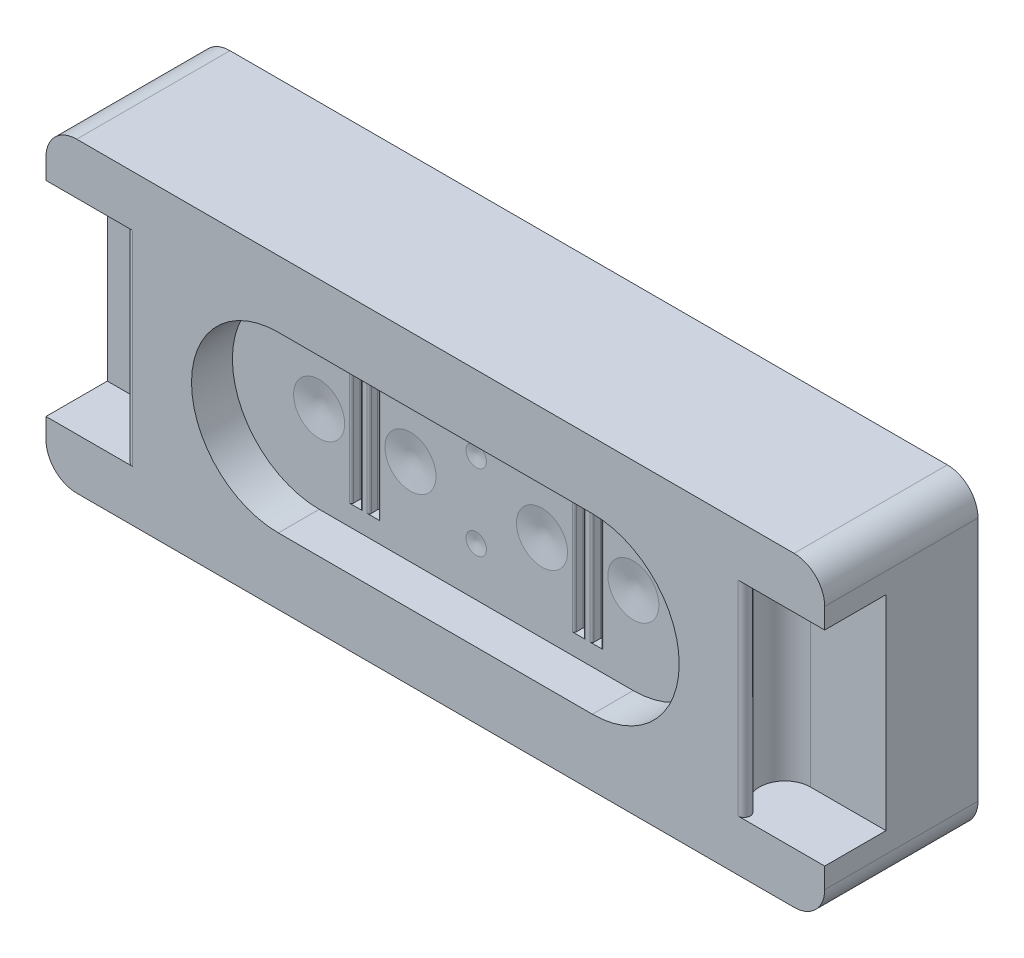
ISO-10303-21;
HEADER;
FILE_DESCRIPTION(('STEP AP214'),'2;1');
FILE_NAME('part.step','',(''),(''),'','','');
FILE_SCHEMA(('AUTOMOTIVE_DESIGN { 1 0 10303 214 1 1 1 1 }'));
ENDSEC;
DATA;
#1=APPLICATION_CONTEXT('core data for automotive mechanical design processes');
#2=APPLICATION_PROTOCOL_DEFINITION('international standard','automotive_design',2000,#1);
#3=PRODUCT_CONTEXT('',#1,'mechanical');
#4=PRODUCT('Part','Part','',(#3));
#5=PRODUCT_RELATED_PRODUCT_CATEGORY('part','',(#4));
#6=PRODUCT_DEFINITION_FORMATION('','',#4);
#7=PRODUCT_DEFINITION_CONTEXT('part definition',#1,'design');
#8=PRODUCT_DEFINITION('design','',#6,#7);
#9=PRODUCT_DEFINITION_SHAPE('','',#8);
#10=(LENGTH_UNIT() NAMED_UNIT(*) SI_UNIT(.MILLI.,.METRE.));
#11=(NAMED_UNIT(*) PLANE_ANGLE_UNIT() SI_UNIT($,.RADIAN.));
#12=(NAMED_UNIT(*) SI_UNIT($,.STERADIAN.) SOLID_ANGLE_UNIT());
#13=UNCERTAINTY_MEASURE_WITH_UNIT(LENGTH_MEASURE(1.E-05),#10,'distance_accuracy_value','');
#14=(GEOMETRIC_REPRESENTATION_CONTEXT(3) GLOBAL_UNCERTAINTY_ASSIGNED_CONTEXT((#13)) GLOBAL_UNIT_ASSIGNED_CONTEXT((#10,
#11,#12)) REPRESENTATION_CONTEXT('',''));
#15=CARTESIAN_POINT('',(0.,0.,0.));
#16=DIRECTION('',(0.,0.,1.));
#17=DIRECTION('',(1.,0.,0.));
#18=AXIS2_PLACEMENT_3D('',#15,#16,#17);
#19=CARTESIAN_POINT('',(0.,0.946095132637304,-1.79605122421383));
#20=DIRECTION('',(0.,0.,1.));
#21=DIRECTION('',(1.,0.,0.));
#22=AXIS2_PLACEMENT_3D('',#19,#20,#21);
#23=CYLINDRICAL_SURFACE('',#22,0.254);
#24=CARTESIAN_POINT('',(0.,0.946095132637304,0.));
#25=DIRECTION('',(0.,0.,1.));
#26=DIRECTION('',(1.,0.,0.));
#27=AXIS2_PLACEMENT_3D('',#24,#25,#26);
#28=CIRCLE('',#27,0.254);
#29=CARTESIAN_POINT('',(0.254,0.946095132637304,0.));
#30=VERTEX_POINT('',#29);
#31=EDGE_CURVE('E12',#30,#30,#28,.F.);
#32=ORIENTED_EDGE('',*,*,#31,.F.);
#33=EDGE_LOOP('',(#32));
#34=FACE_BOUND('',#33,.T.);
#35=CARTESIAN_POINT('',(0.,0.946095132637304,2.794));
#36=DIRECTION('',(0.,0.,1.));
#37=DIRECTION('',(1.,0.,0.));
#38=AXIS2_PLACEMENT_3D('',#35,#36,#37);
#39=CIRCLE('',#38,0.254);
#40=CARTESIAN_POINT('',(0.254,0.946095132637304,2.794));
#41=VERTEX_POINT('',#40);
#42=EDGE_CURVE('E59',#41,#41,#39,.T.);
#43=ORIENTED_EDGE('',*,*,#42,.F.);
#44=EDGE_LOOP('',(#43));
#45=FACE_BOUND('',#44,.T.);
#46=ADVANCED_FACE('F53',(#34,#45),#23,.T.);
#47=CARTESIAN_POINT('',(-9.677499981,-3.81,0.));
#48=DIRECTION('',(0.,0.,1.));
#49=DIRECTION('',(1.,0.,0.));
#50=AXIS2_PLACEMENT_3D('',#47,#48,#49);
#51=PLANE('',#50);
#52=ORIENTED_EDGE('',*,*,#31,.T.);
#53=EDGE_LOOP('',(#52));
#54=FACE_BOUND('',#53,.T.);
#55=ADVANCED_FACE('F66',(#54),#51,.F.);
#56=CARTESIAN_POINT('',(0.,0.946095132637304,2.794));
#57=DIRECTION('',(0.,0.,1.));
#58=DIRECTION('',(1.,0.,0.));
#59=AXIS2_PLACEMENT_3D('',#56,#57,#58);
#60=CONICAL_SURFACE('',#59,0.254,1.39626340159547);
#61=CARTESIAN_POINT('',(0.,0.946095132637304,2.74921294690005));
#62=VERTEX_POINT('',#61);
#63=VERTEX_LOOP('',#62);
#64=FACE_BOUND('',#63,.T.);
#65=ORIENTED_EDGE('',*,*,#42,.T.);
#66=EDGE_LOOP('',(#65));
#67=FACE_BOUND('',#66,.T.);
#68=ADVANCED_FACE('F63',(#64,#67),#60,.F.);
#69=CLOSED_SHELL('',(#46,#55,#68));
#70=MANIFOLD_SOLID_BREP('B2',#69);
#71=CARTESIAN_POINT('',(3.905,0.,-1.79605122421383));
#72=DIRECTION('',(0.,0.,1.));
#73=DIRECTION('',(1.,0.,0.));
#74=AXIS2_PLACEMENT_3D('',#71,#72,#73);
#75=CYLINDRICAL_SURFACE('',#74,0.635000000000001);
#76=CARTESIAN_POINT('',(3.905,0.,0.));
#77=DIRECTION('',(0.,0.,1.));
#78=DIRECTION('',(1.,0.,0.));
#79=AXIS2_PLACEMENT_3D('',#76,#77,#78);
#80=CIRCLE('',#79,0.635000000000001);
#81=CARTESIAN_POINT('',(4.54,0.,0.));
#82=VERTEX_POINT('',#81);
#83=EDGE_CURVE('E51',#82,#82,#80,.F.);
#84=ORIENTED_EDGE('',*,*,#83,.F.);
#85=EDGE_LOOP('',(#84));
#86=FACE_BOUND('',#85,.T.);
#87=CARTESIAN_POINT('',(3.905,0.,2.794));
#88=DIRECTION('',(0.,0.,1.));
#89=DIRECTION('',(1.,0.,0.));
#90=AXIS2_PLACEMENT_3D('',#87,#88,#89);
#91=CIRCLE('',#90,0.635000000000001);
#92=CARTESIAN_POINT('',(4.54,0.,2.794));
#93=VERTEX_POINT('',#92);
#94=EDGE_CURVE('E114',#93,#93,#91,.T.);
#95=ORIENTED_EDGE('',*,*,#94,.F.);
#96=EDGE_LOOP('',(#95));
#97=FACE_BOUND('',#96,.T.);
#98=ADVANCED_FACE('F108',(#86,#97),#75,.T.);
#99=CARTESIAN_POINT('',(-9.677499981,-3.81,0.));
#100=DIRECTION('',(0.,0.,1.));
#101=DIRECTION('',(1.,0.,0.));
#102=AXIS2_PLACEMENT_3D('',#99,#100,#101);
#103=PLANE('',#102);
#104=ORIENTED_EDGE('',*,*,#83,.T.);
#105=EDGE_LOOP('',(#104));
#106=FACE_BOUND('',#105,.T.);
#107=ADVANCED_FACE('F120',(#106),#103,.F.);
#108=CARTESIAN_POINT('',(3.905,0.,2.794));
#109=DIRECTION('',(0.,0.,1.));
#110=DIRECTION('',(1.,0.,0.));
#111=AXIS2_PLACEMENT_3D('',#108,#109,#110);
#112=CONICAL_SURFACE('',#111,0.635000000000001,1.39626340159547);
#113=CARTESIAN_POINT('',(3.905,0.,2.68203236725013));
#114=VERTEX_POINT('',#113);
#115=VERTEX_LOOP('',#114);
#116=FACE_BOUND('',#115,.T.);
#117=ORIENTED_EDGE('',*,*,#94,.T.);
#118=EDGE_LOOP('',(#117));
#119=FACE_BOUND('',#118,.T.);
#120=ADVANCED_FACE('F117',(#116,#119),#112,.F.);
#121=CLOSED_SHELL('',(#98,#107,#120));
#122=MANIFOLD_SOLID_BREP('B6',#121);
#123=CARTESIAN_POINT('',(1.635,0.,-1.79605122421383));
#124=DIRECTION('',(0.,0.,1.));
#125=DIRECTION('',(1.,0.,0.));
#126=AXIS2_PLACEMENT_3D('',#123,#124,#125);
#127=CYLINDRICAL_SURFACE('',#126,0.635000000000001);
#128=CARTESIAN_POINT('',(1.635,0.,0.));
#129=DIRECTION('',(0.,0.,1.));
#130=DIRECTION('',(1.,0.,0.));
#131=AXIS2_PLACEMENT_3D('',#128,#129,#130);
#132=CIRCLE('',#131,0.635000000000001);
#133=CARTESIAN_POINT('',(2.27,0.,0.));
#134=VERTEX_POINT('',#133);
#135=EDGE_CURVE('E106',#134,#134,#132,.F.);
#136=ORIENTED_EDGE('',*,*,#135,.F.);
#137=EDGE_LOOP('',(#136));
#138=FACE_BOUND('',#137,.T.);
#139=CARTESIAN_POINT('',(1.635,0.,2.794));
#140=DIRECTION('',(0.,0.,1.));
#141=DIRECTION('',(1.,0.,0.));
#142=AXIS2_PLACEMENT_3D('',#139,#140,#141);
#143=CIRCLE('',#142,0.635000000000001);
#144=CARTESIAN_POINT('',(2.27,0.,2.794));
#145=VERTEX_POINT('',#144);
#146=EDGE_CURVE('E166',#145,#145,#143,.T.);
#147=ORIENTED_EDGE('',*,*,#146,.F.);
#148=EDGE_LOOP('',(#147));
#149=FACE_BOUND('',#148,.T.);
#150=ADVANCED_FACE('F160',(#138,#149),#127,.T.);
#151=CARTESIAN_POINT('',(-9.677499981,-3.81,0.));
#152=DIRECTION('',(0.,0.,1.));
#153=DIRECTION('',(1.,0.,0.));
#154=AXIS2_PLACEMENT_3D('',#151,#152,#153);
#155=PLANE('',#154);
#156=ORIENTED_EDGE('',*,*,#135,.T.);
#157=EDGE_LOOP('',(#156));
#158=FACE_BOUND('',#157,.T.);
#159=ADVANCED_FACE('F173',(#158),#155,.F.);
#160=CARTESIAN_POINT('',(1.635,0.,2.794));
#161=DIRECTION('',(0.,0.,1.));
#162=DIRECTION('',(1.,0.,0.));
#163=AXIS2_PLACEMENT_3D('',#160,#161,#162);
#164=CONICAL_SURFACE('',#163,0.635000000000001,1.39626340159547);
#165=CARTESIAN_POINT('',(1.635,0.,2.68203236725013));
#166=VERTEX_POINT('',#165);
#167=VERTEX_LOOP('',#166);
#168=FACE_BOUND('',#167,.T.);
#169=ORIENTED_EDGE('',*,*,#146,.T.);
#170=EDGE_LOOP('',(#169));
#171=FACE_BOUND('',#170,.T.);
#172=ADVANCED_FACE('F170',(#168,#171),#164,.F.);
#173=CLOSED_SHELL('',(#150,#159,#172));
#174=MANIFOLD_SOLID_BREP('B45',#173);
#175=CARTESIAN_POINT('',(0.,-0.946095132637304,-1.79605122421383));
#176=DIRECTION('',(0.,0.,1.));
#177=DIRECTION('',(1.,0.,0.));
#178=AXIS2_PLACEMENT_3D('',#175,#176,#177);
#179=CYLINDRICAL_SURFACE('',#178,0.254);
#180=CARTESIAN_POINT('',(0.,-0.946095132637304,0.));
#181=DIRECTION('',(0.,0.,1.));
#182=DIRECTION('',(1.,0.,0.));
#183=AXIS2_PLACEMENT_3D('',#180,#181,#182);
#184=CIRCLE('',#183,0.254);
#185=CARTESIAN_POINT('',(0.254,-0.946095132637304,0.));
#186=VERTEX_POINT('',#185);
#187=EDGE_CURVE('E158',#186,#186,#184,.F.);
#188=ORIENTED_EDGE('',*,*,#187,.F.);
#189=EDGE_LOOP('',(#188));
#190=FACE_BOUND('',#189,.T.);
#191=CARTESIAN_POINT('',(0.,-0.946095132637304,2.794));
#192=DIRECTION('',(0.,0.,1.));
#193=DIRECTION('',(1.,0.,0.));
#194=AXIS2_PLACEMENT_3D('',#191,#192,#193);
#195=CIRCLE('',#194,0.254);
#196=CARTESIAN_POINT('',(0.254,-0.946095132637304,2.794));
#197=VERTEX_POINT('',#196);
#198=EDGE_CURVE('E222',#197,#197,#195,.T.);
#199=ORIENTED_EDGE('',*,*,#198,.F.);
#200=EDGE_LOOP('',(#199));
#201=FACE_BOUND('',#200,.T.);
#202=ADVANCED_FACE('F216',(#190,#201),#179,.T.);
#203=CARTESIAN_POINT('',(-9.677499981,-3.81,0.));
#204=DIRECTION('',(0.,0.,1.));
#205=DIRECTION('',(1.,0.,0.));
#206=AXIS2_PLACEMENT_3D('',#203,#204,#205);
#207=PLANE('',#206);
#208=ORIENTED_EDGE('',*,*,#187,.T.);
#209=EDGE_LOOP('',(#208));
#210=FACE_BOUND('',#209,.T.);
#211=ADVANCED_FACE('F229',(#210),#207,.F.);
#212=CARTESIAN_POINT('',(0.,-0.946095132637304,2.794));
#213=DIRECTION('',(0.,0.,1.));
#214=DIRECTION('',(1.,0.,0.));
#215=AXIS2_PLACEMENT_3D('',#212,#213,#214);
#216=CONICAL_SURFACE('',#215,0.254,1.39626340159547);
#217=CARTESIAN_POINT('',(0.,-0.946095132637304,2.74921294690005));
#218=VERTEX_POINT('',#217);
#219=VERTEX_LOOP('',#218);
#220=FACE_BOUND('',#219,.T.);
#221=ORIENTED_EDGE('',*,*,#198,.T.);
#222=EDGE_LOOP('',(#221));
#223=FACE_BOUND('',#222,.T.);
#224=ADVANCED_FACE('F226',(#220,#223),#216,.F.);
#225=CLOSED_SHELL('',(#202,#211,#224));
#226=MANIFOLD_SOLID_BREP('B100',#225);
#227=CARTESIAN_POINT('',(-1.635,0.,-1.79605122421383));
#228=DIRECTION('',(0.,0.,1.));
#229=DIRECTION('',(1.,0.,0.));
#230=AXIS2_PLACEMENT_3D('',#227,#228,#229);
#231=CYLINDRICAL_SURFACE('',#230,0.635);
#232=CARTESIAN_POINT('',(-1.635,0.,0.));
#233=DIRECTION('',(0.,0.,1.));
#234=DIRECTION('',(1.,0.,0.));
#235=AXIS2_PLACEMENT_3D('',#232,#233,#234);
#236=CIRCLE('',#235,0.635);
#237=CARTESIAN_POINT('',(-1.,0.,0.));
#238=VERTEX_POINT('',#237);
#239=EDGE_CURVE('E214',#238,#238,#236,.F.);
#240=ORIENTED_EDGE('',*,*,#239,.F.);
#241=EDGE_LOOP('',(#240));
#242=FACE_BOUND('',#241,.T.);
#243=CARTESIAN_POINT('',(-1.635,0.,2.794));
#244=DIRECTION('',(0.,0.,1.));
#245=DIRECTION('',(1.,0.,0.));
#246=AXIS2_PLACEMENT_3D('',#243,#244,#245);
#247=CIRCLE('',#246,0.635);
#248=CARTESIAN_POINT('',(-1.,0.,2.794));
#249=VERTEX_POINT('',#248);
#250=EDGE_CURVE('E277',#249,#249,#247,.T.);
#251=ORIENTED_EDGE('',*,*,#250,.F.);
#252=EDGE_LOOP('',(#251));
#253=FACE_BOUND('',#252,.T.);
#254=ADVANCED_FACE('F271',(#242,#253),#231,.T.);
#255=CARTESIAN_POINT('',(-9.677499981,-3.81,0.));
#256=DIRECTION('',(0.,0.,1.));
#257=DIRECTION('',(1.,0.,0.));
#258=AXIS2_PLACEMENT_3D('',#255,#256,#257);
#259=PLANE('',#258);
#260=ORIENTED_EDGE('',*,*,#239,.T.);
#261=EDGE_LOOP('',(#260));
#262=FACE_BOUND('',#261,.T.);
#263=ADVANCED_FACE('F284',(#262),#259,.F.);
#264=CARTESIAN_POINT('',(-1.635,0.,2.794));
#265=DIRECTION('',(0.,0.,1.));
#266=DIRECTION('',(1.,0.,0.));
#267=AXIS2_PLACEMENT_3D('',#264,#265,#266);
#268=CONICAL_SURFACE('',#267,0.635,1.39626340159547);
#269=CARTESIAN_POINT('',(-1.635,0.,2.68203236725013));
#270=VERTEX_POINT('',#269);
#271=VERTEX_LOOP('',#270);
#272=FACE_BOUND('',#271,.T.);
#273=ORIENTED_EDGE('',*,*,#250,.T.);
#274=EDGE_LOOP('',(#273));
#275=FACE_BOUND('',#274,.T.);
#276=ADVANCED_FACE('F281',(#272,#275),#268,.F.);
#277=CLOSED_SHELL('',(#254,#263,#276));
#278=MANIFOLD_SOLID_BREP('B152',#277);
#279=CARTESIAN_POINT('',(-3.905,0.,-1.79605122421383));
#280=DIRECTION('',(0.,0.,1.));
#281=DIRECTION('',(1.,0.,0.));
#282=AXIS2_PLACEMENT_3D('',#279,#280,#281);
#283=CYLINDRICAL_SURFACE('',#282,0.635000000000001);
#284=CARTESIAN_POINT('',(-3.905,0.,0.));
#285=DIRECTION('',(0.,0.,1.));
#286=DIRECTION('',(1.,0.,0.));
#287=AXIS2_PLACEMENT_3D('',#284,#285,#286);
#288=CIRCLE('',#287,0.635000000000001);
#289=CARTESIAN_POINT('',(-3.27,0.,0.));
#290=VERTEX_POINT('',#289);
#291=EDGE_CURVE('E269',#290,#290,#288,.F.);
#292=ORIENTED_EDGE('',*,*,#291,.F.);
#293=EDGE_LOOP('',(#292));
#294=FACE_BOUND('',#293,.T.);
#295=CARTESIAN_POINT('',(-3.905,0.,2.794));
#296=DIRECTION('',(0.,0.,1.));
#297=DIRECTION('',(1.,0.,0.));
#298=AXIS2_PLACEMENT_3D('',#295,#296,#297);
#299=CIRCLE('',#298,0.635000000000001);
#300=CARTESIAN_POINT('',(-3.27,0.,2.794));
#301=VERTEX_POINT('',#300);
#302=EDGE_CURVE('E331',#301,#301,#299,.T.);
#303=ORIENTED_EDGE('',*,*,#302,.F.);
#304=EDGE_LOOP('',(#303));
#305=FACE_BOUND('',#304,.T.);
#306=ADVANCED_FACE('F325',(#294,#305),#283,.T.);
#307=CARTESIAN_POINT('',(-9.677499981,-3.81,0.));
#308=DIRECTION('',(0.,0.,1.));
#309=DIRECTION('',(1.,0.,0.));
#310=AXIS2_PLACEMENT_3D('',#307,#308,#309);
#311=PLANE('',#310);
#312=ORIENTED_EDGE('',*,*,#291,.T.);
#313=EDGE_LOOP('',(#312));
#314=FACE_BOUND('',#313,.T.);
#315=ADVANCED_FACE('F337',(#314),#311,.F.);
#316=CARTESIAN_POINT('',(-3.905,0.,2.794));
#317=DIRECTION('',(0.,0.,1.));
#318=DIRECTION('',(1.,0.,0.));
#319=AXIS2_PLACEMENT_3D('',#316,#317,#318);
#320=CONICAL_SURFACE('',#319,0.635000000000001,1.39626340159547);
#321=CARTESIAN_POINT('',(-3.905,0.,2.68203236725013));
#322=VERTEX_POINT('',#321);
#323=VERTEX_LOOP('',#322);
#324=FACE_BOUND('',#323,.T.);
#325=ORIENTED_EDGE('',*,*,#302,.T.);
#326=EDGE_LOOP('',(#325));
#327=FACE_BOUND('',#326,.T.);
#328=ADVANCED_FACE('F334',(#324,#327),#320,.F.);
#329=CLOSED_SHELL('',(#306,#315,#328));
#330=MANIFOLD_SOLID_BREP('B208',#329);
#331=CARTESIAN_POINT('',(7.8011,-2.54,2.921));
#332=DIRECTION('',(0.,1.,0.));
#333=DIRECTION('',(0.,0.,1.));
#334=AXIS2_PLACEMENT_3D('',#331,#332,#333);
#335=CYLINDRICAL_SURFACE('',#334,0.635);
#336=DIRECTION('',(0.,1.,0.));
#337=VECTOR('',#336,1.);
#338=CARTESIAN_POINT('',(7.57671043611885,-2.94549373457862,3.51503225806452));
#339=LINE('',#338,#337);
#340=CARTESIAN_POINT('',(7.57671043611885,-2.54,3.51503225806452));
#341=VERTEX_POINT('',#340);
#342=CARTESIAN_POINT('',(7.57671043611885,2.54,3.51503225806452));
#343=VERTEX_POINT('',#342);
#344=EDGE_CURVE('E747',#341,#343,#339,.T.);
#345=ORIENTED_EDGE('',*,*,#344,.F.);
#346=CARTESIAN_POINT('',(7.8011,-2.54,2.921));
#347=DIRECTION('',(0.,1.,0.));
#348=DIRECTION('',(0.,0.,1.));
#349=AXIS2_PLACEMENT_3D('',#346,#347,#348);
#350=CIRCLE('',#349,0.635);
#351=CARTESIAN_POINT('',(7.8011,-2.54,2.286));
#352=VERTEX_POINT('',#351);
#353=EDGE_CURVE('E799',#352,#341,#350,.T.);
#354=ORIENTED_EDGE('',*,*,#353,.F.);
#355=DIRECTION('',(0.,1.,0.));
#356=VECTOR('',#355,1.);
#357=CARTESIAN_POINT('',(7.8011,-2.54,2.286));
#358=LINE('',#357,#356);
#359=CARTESIAN_POINT('',(7.8011,2.54,2.286));
#360=VERTEX_POINT('',#359);
#361=EDGE_CURVE('E814',#352,#360,#358,.T.);
#362=ORIENTED_EDGE('',*,*,#361,.T.);
#363=CARTESIAN_POINT('',(7.8011,2.54,2.921));
#364=DIRECTION('',(0.,1.,0.));
#365=DIRECTION('',(0.,0.,1.));
#366=AXIS2_PLACEMENT_3D('',#363,#364,#365);
#367=CIRCLE('',#366,0.635);
#368=EDGE_CURVE('E740',#360,#343,#367,.T.);
#369=ORIENTED_EDGE('',*,*,#368,.T.);
#370=EDGE_LOOP('',(#345,#354,#362,#369));
#371=FACE_BOUND('',#370,.T.);
#372=ADVANCED_FACE('F368',(#371),#335,.F.);
#373=CARTESIAN_POINT('',(-9.677499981,-3.81,3.81));
#374=DIRECTION('',(0.,0.,1.));
#375=DIRECTION('',(1.,0.,0.));
#376=AXIS2_PLACEMENT_3D('',#373,#374,#375);
#377=PLANE('',#376);
#378=DIRECTION('',(0.,-1.,0.));
#379=VECTOR('',#378,1.);
#380=CARTESIAN_POINT('',(-9.677499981,3.81,3.81));
#381=LINE('',#380,#379);
#382=CARTESIAN_POINT('',(-9.677499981,-2.54,3.81));
#383=VERTEX_POINT('',#382);
#384=CARTESIAN_POINT('',(-9.677499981,-3.048,3.81));
#385=VERTEX_POINT('',#384);
#386=EDGE_CURVE('E902',#383,#385,#381,.T.);
#387=ORIENTED_EDGE('',*,*,#386,.T.);
#388=CARTESIAN_POINT('',(-8.915499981,-3.048,3.81));
#389=DIRECTION('',(0.,0.,1.));
#390=DIRECTION('',(1.,0.,0.));
#391=AXIS2_PLACEMENT_3D('',#388,#389,#390);
#392=CIRCLE('',#391,0.762);
#393=CARTESIAN_POINT('',(-8.915499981,-3.81,3.81));
#394=VERTEX_POINT('',#393);
#395=EDGE_CURVE('E948',#385,#394,#392,.T.);
#396=ORIENTED_EDGE('',*,*,#395,.T.);
#397=DIRECTION('',(1.,0.,0.));
#398=VECTOR('',#397,1.);
#399=CARTESIAN_POINT('',(-9.677499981,-3.81,3.81));
#400=LINE('',#399,#398);
#401=CARTESIAN_POINT('',(8.915499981,-3.81,3.81));
#402=VERTEX_POINT('',#401);
#403=EDGE_CURVE('E901',#394,#402,#400,.T.);
#404=ORIENTED_EDGE('',*,*,#403,.T.);
#405=CARTESIAN_POINT('',(8.915499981,-3.048,3.81));
#406=DIRECTION('',(0.,0.,1.));
#407=DIRECTION('',(1.,0.,0.));
#408=AXIS2_PLACEMENT_3D('',#405,#406,#407);
#409=CIRCLE('',#408,0.762);
#410=CARTESIAN_POINT('',(9.677499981,-3.048,3.81));
#411=VERTEX_POINT('',#410);
#412=EDGE_CURVE('E942',#402,#411,#409,.T.);
#413=ORIENTED_EDGE('',*,*,#412,.T.);
#414=DIRECTION('',(0.,1.,0.));
#415=VECTOR('',#414,1.);
#416=CARTESIAN_POINT('',(9.677499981,3.81,3.81));
#417=LINE('',#416,#415);
#418=CARTESIAN_POINT('',(9.677499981,-2.54,3.81));
#419=VERTEX_POINT('',#418);
#420=EDGE_CURVE('E907',#411,#419,#417,.T.);
#421=ORIENTED_EDGE('',*,*,#420,.T.);
#422=DIRECTION('',(1.,0.,0.));
#423=VECTOR('',#422,1.);
#424=CARTESIAN_POINT('',(7.8011,-2.54,3.81));
#425=LINE('',#424,#423);
#426=CARTESIAN_POINT('',(7.52285694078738,-2.54,3.81));
#427=VERTEX_POINT('',#426);
#428=EDGE_CURVE('E755',#427,#419,#425,.T.);
#429=ORIENTED_EDGE('',*,*,#428,.F.);
#430=DIRECTION('',(0.,1.,0.));
#431=VECTOR('',#430,1.);
#432=CARTESIAN_POINT('',(7.52285694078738,-2.94549373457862,3.81));
#433=LINE('',#432,#431);
#434=CARTESIAN_POINT('',(7.52285694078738,2.54,3.81));
#435=VERTEX_POINT('',#434);
#436=EDGE_CURVE('E745',#427,#435,#433,.T.);
#437=ORIENTED_EDGE('',*,*,#436,.T.);
#438=DIRECTION('',(1.,0.,0.));
#439=VECTOR('',#438,1.);
#440=CARTESIAN_POINT('',(7.8011,2.54,3.81));
#441=LINE('',#440,#439);
#442=CARTESIAN_POINT('',(9.677499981,2.54,3.81));
#443=VERTEX_POINT('',#442);
#444=EDGE_CURVE('E727',#435,#443,#441,.T.);
#445=ORIENTED_EDGE('',*,*,#444,.T.);
#446=CARTESIAN_POINT('',(9.677499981,3.048,3.81));
#447=VERTEX_POINT('',#446);
#448=EDGE_CURVE('E906',#443,#447,#417,.T.);
#449=ORIENTED_EDGE('',*,*,#448,.T.);
#450=CARTESIAN_POINT('',(8.915499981,3.048,3.81));
#451=DIRECTION('',(0.,0.,1.));
#452=DIRECTION('',(1.,0.,0.));
#453=AXIS2_PLACEMENT_3D('',#450,#451,#452);
#454=CIRCLE('',#453,0.762);
#455=CARTESIAN_POINT('',(8.915499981,3.81,3.81));
#456=VERTEX_POINT('',#455);
#457=EDGE_CURVE('E944',#447,#456,#454,.T.);
#458=ORIENTED_EDGE('',*,*,#457,.T.);
#459=DIRECTION('',(-1.,0.,0.));
#460=VECTOR('',#459,1.);
#461=CARTESIAN_POINT('',(-9.677499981,3.81,3.81));
#462=LINE('',#461,#460);
#463=CARTESIAN_POINT('',(-8.915499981,3.81,3.81));
#464=VERTEX_POINT('',#463);
#465=EDGE_CURVE('E909',#456,#464,#462,.T.);
#466=ORIENTED_EDGE('',*,*,#465,.T.);
#467=CARTESIAN_POINT('',(-8.915499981,3.048,3.81));
#468=DIRECTION('',(0.,0.,1.));
#469=DIRECTION('',(1.,0.,0.));
#470=AXIS2_PLACEMENT_3D('',#467,#468,#469);
#471=CIRCLE('',#470,0.762);
#472=CARTESIAN_POINT('',(-9.677499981,3.048,3.81));
#473=VERTEX_POINT('',#472);
#474=EDGE_CURVE('E946',#464,#473,#471,.T.);
#475=ORIENTED_EDGE('',*,*,#474,.T.);
#476=CARTESIAN_POINT('',(-9.677499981,2.54,3.81));
#477=VERTEX_POINT('',#476);
#478=EDGE_CURVE('E899',#473,#477,#381,.T.);
#479=ORIENTED_EDGE('',*,*,#478,.T.);
#480=DIRECTION('',(1.,0.,0.));
#481=VECTOR('',#480,1.);
#482=CARTESIAN_POINT('',(-7.8011,2.54,3.81));
#483=LINE('',#482,#481);
#484=CARTESIAN_POINT('',(-7.52285694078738,2.54,3.81));
#485=VERTEX_POINT('',#484);
#486=EDGE_CURVE('E778',#477,#485,#483,.T.);
#487=ORIENTED_EDGE('',*,*,#486,.T.);
#488=DIRECTION('',(0.,1.,0.));
#489=VECTOR('',#488,1.);
#490=CARTESIAN_POINT('',(-7.52285694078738,-2.94549373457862,3.81));
#491=LINE('',#490,#489);
#492=CARTESIAN_POINT('',(-7.52285694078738,-2.54,3.81));
#493=VERTEX_POINT('',#492);
#494=EDGE_CURVE('E770',#493,#485,#491,.T.);
#495=ORIENTED_EDGE('',*,*,#494,.F.);
#496=DIRECTION('',(1.,0.,0.));
#497=VECTOR('',#496,1.);
#498=CARTESIAN_POINT('',(-7.8011,-2.54,3.81));
#499=LINE('',#498,#497);
#500=EDGE_CURVE('E783',#383,#493,#499,.T.);
#501=ORIENTED_EDGE('',*,*,#500,.F.);
#502=EDGE_LOOP('',(#387,#396,#404,#413,#421,#429,#437,#445,#449,#458,#466,#475,#479,#487,#495,#501));
#503=FACE_BOUND('',#502,.T.);
#504=CARTESIAN_POINT('',(-3.901539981,0.,3.81));
#505=DIRECTION('',(0.,0.,1.));
#506=DIRECTION('',(1.,0.,0.));
#507=AXIS2_PLACEMENT_3D('',#504,#505,#506);
#508=CIRCLE('',#507,2.159);
#509=CARTESIAN_POINT('',(-3.901539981,2.159,3.81));
#510=VERTEX_POINT('',#509);
#511=CARTESIAN_POINT('',(-3.901539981,-2.159,3.81));
#512=VERTEX_POINT('',#511);
#513=EDGE_CURVE('E855',#510,#512,#508,.T.);
#514=ORIENTED_EDGE('',*,*,#513,.F.);
#515=DIRECTION('',(-1.,0.,0.));
#516=VECTOR('',#515,1.);
#517=CARTESIAN_POINT('',(-3.901539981,2.159,3.81));
#518=LINE('',#517,#516);
#519=CARTESIAN_POINT('',(3.901539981,2.159,3.81));
#520=VERTEX_POINT('',#519);
#521=EDGE_CURVE('E864',#520,#510,#518,.T.);
#522=ORIENTED_EDGE('',*,*,#521,.F.);
#523=CARTESIAN_POINT('',(3.901539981,0.,3.81));
#524=DIRECTION('',(0.,0.,1.));
#525=DIRECTION('',(1.,0.,0.));
#526=AXIS2_PLACEMENT_3D('',#523,#524,#525);
#527=CIRCLE('',#526,2.159);
#528=CARTESIAN_POINT('',(3.901539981,-2.159,3.81));
#529=VERTEX_POINT('',#528);
#530=EDGE_CURVE('E882',#529,#520,#527,.T.);
#531=ORIENTED_EDGE('',*,*,#530,.F.);
#532=DIRECTION('',(1.,0.,0.));
#533=VECTOR('',#532,1.);
#534=CARTESIAN_POINT('',(-3.901539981,-2.159,3.81));
#535=LINE('',#534,#533);
#536=EDGE_CURVE('E878',#512,#529,#535,.T.);
#537=ORIENTED_EDGE('',*,*,#536,.F.);
#538=EDGE_LOOP('',(#514,#522,#531,#537));
#539=FACE_BOUND('',#538,.T.);
#540=ADVANCED_FACE('F752',(#503,#539),#377,.T.);
#541=CARTESIAN_POINT('',(-9.677499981,3.81,3.81));
#542=DIRECTION('',(1.,0.,0.));
#543=DIRECTION('',(0.,0.,-1.));
#544=AXIS2_PLACEMENT_3D('',#541,#542,#543);
#545=PLANE('',#544);
#546=DIRECTION('',(0.,-1.,0.));
#547=VECTOR('',#546,1.);
#548=CARTESIAN_POINT('',(-9.677499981,3.81,0.));
#549=LINE('',#548,#547);
#550=CARTESIAN_POINT('',(-9.677499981,3.048,0.));
#551=VERTEX_POINT('',#550);
#552=CARTESIAN_POINT('',(-9.677499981,-3.048,0.));
#553=VERTEX_POINT('',#552);
#554=EDGE_CURVE('E891',#551,#553,#549,.T.);
#555=ORIENTED_EDGE('',*,*,#554,.T.);
#556=DIRECTION('',(0.,0.,-1.));
#557=VECTOR('',#556,1.);
#558=CARTESIAN_POINT('',(-9.677499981,-3.048,3.81));
#559=LINE('',#558,#557);
#560=EDGE_CURVE('E940',#553,#385,#559,.F.);
#561=ORIENTED_EDGE('',*,*,#560,.T.);
#562=ORIENTED_EDGE('',*,*,#386,.F.);
#563=DIRECTION('',(0.,0.,1.));
#564=VECTOR('',#563,1.);
#565=CARTESIAN_POINT('',(-9.677499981,-2.54,2.286));
#566=LINE('',#565,#564);
#567=CARTESIAN_POINT('',(-9.677499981,-2.54,2.286));
#568=VERTEX_POINT('',#567);
#569=EDGE_CURVE('E781',#568,#383,#566,.T.);
#570=ORIENTED_EDGE('',*,*,#569,.F.);
#571=DIRECTION('',(0.,1.,0.));
#572=VECTOR('',#571,1.);
#573=CARTESIAN_POINT('',(-9.677499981,-2.54,2.286));
#574=LINE('',#573,#572);
#575=CARTESIAN_POINT('',(-9.677499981,2.54,2.286));
#576=VERTEX_POINT('',#575);
#577=EDGE_CURVE('E794',#568,#576,#574,.T.);
#578=ORIENTED_EDGE('',*,*,#577,.T.);
#579=DIRECTION('',(0.,0.,1.));
#580=VECTOR('',#579,1.);
#581=CARTESIAN_POINT('',(-9.677499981,2.54,2.286));
#582=LINE('',#581,#580);
#583=EDGE_CURVE('E790',#576,#477,#582,.T.);
#584=ORIENTED_EDGE('',*,*,#583,.T.);
#585=ORIENTED_EDGE('',*,*,#478,.F.);
#586=DIRECTION('',(0.,0.,-1.));
#587=VECTOR('',#586,1.);
#588=CARTESIAN_POINT('',(-9.677499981,3.048,3.81));
#589=LINE('',#588,#587);
#590=EDGE_CURVE('E937',#473,#551,#589,.T.);
#591=ORIENTED_EDGE('',*,*,#590,.T.);
#592=EDGE_LOOP('',(#555,#561,#562,#570,#578,#584,#585,#591));
#593=FACE_BOUND('',#592,.T.);
#594=ADVANCED_FACE('F1198',(#593),#545,.F.);
#595=CARTESIAN_POINT('',(9.677499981,3.81,3.81));
#596=DIRECTION('',(-1.,0.,0.));
#597=DIRECTION('',(0.,0.,1.));
#598=AXIS2_PLACEMENT_3D('',#595,#596,#597);
#599=PLANE('',#598);
#600=DIRECTION('',(0.,1.,0.));
#601=VECTOR('',#600,1.);
#602=CARTESIAN_POINT('',(9.677499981,3.81,0.));
#603=LINE('',#602,#601);
#604=CARTESIAN_POINT('',(9.677499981,-3.048,0.));
#605=VERTEX_POINT('',#604);
#606=CARTESIAN_POINT('',(9.677499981,3.048,0.));
#607=VERTEX_POINT('',#606);
#608=EDGE_CURVE('E919',#605,#607,#603,.T.);
#609=ORIENTED_EDGE('',*,*,#608,.T.);
#610=DIRECTION('',(0.,0.,-1.));
#611=VECTOR('',#610,1.);
#612=CARTESIAN_POINT('',(9.677499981,3.048,3.81));
#613=LINE('',#612,#611);
#614=EDGE_CURVE('E958',#607,#447,#613,.F.);
#615=ORIENTED_EDGE('',*,*,#614,.T.);
#616=ORIENTED_EDGE('',*,*,#448,.F.);
#617=DIRECTION('',(0.,0.,-1.));
#618=VECTOR('',#617,1.);
#619=CARTESIAN_POINT('',(9.677499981,2.54,2.286));
#620=LINE('',#619,#618);
#621=CARTESIAN_POINT('',(9.677499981,2.54,2.286));
#622=VERTEX_POINT('',#621);
#623=EDGE_CURVE('E735',#443,#622,#620,.T.);
#624=ORIENTED_EDGE('',*,*,#623,.T.);
#625=DIRECTION('',(0.,1.,0.));
#626=VECTOR('',#625,1.);
#627=CARTESIAN_POINT('',(9.677499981,-2.54,2.286));
#628=LINE('',#627,#626);
#629=CARTESIAN_POINT('',(9.677499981,-2.54,2.286));
#630=VERTEX_POINT('',#629);
#631=EDGE_CURVE('E809',#630,#622,#628,.T.);
#632=ORIENTED_EDGE('',*,*,#631,.F.);
#633=DIRECTION('',(0.,0.,-1.));
#634=VECTOR('',#633,1.);
#635=CARTESIAN_POINT('',(9.677499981,-2.54,2.286));
#636=LINE('',#635,#634);
#637=EDGE_CURVE('E804',#419,#630,#636,.T.);
#638=ORIENTED_EDGE('',*,*,#637,.F.);
#639=ORIENTED_EDGE('',*,*,#420,.F.);
#640=DIRECTION('',(0.,0.,-1.));
#641=VECTOR('',#640,1.);
#642=CARTESIAN_POINT('',(9.677499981,-3.048,3.81));
#643=LINE('',#642,#641);
#644=EDGE_CURVE('E955',#411,#605,#643,.T.);
#645=ORIENTED_EDGE('',*,*,#644,.T.);
#646=EDGE_LOOP('',(#609,#615,#616,#624,#632,#638,#639,#645));
#647=FACE_BOUND('',#646,.T.);
#648=ADVANCED_FACE('F1175',(#647),#599,.F.);
#649=CARTESIAN_POINT('',(-9.677499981,-3.81,3.81));
#650=DIRECTION('',(0.,1.,0.));
#651=DIRECTION('',(0.,0.,1.));
#652=AXIS2_PLACEMENT_3D('',#649,#650,#651);
#653=PLANE('',#652);
#654=ORIENTED_EDGE('',*,*,#403,.F.);
#655=DIRECTION('',(0.,0.,-1.));
#656=VECTOR('',#655,1.);
#657=CARTESIAN_POINT('',(-8.915499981,-3.81,3.81));
#658=LINE('',#657,#656);
#659=CARTESIAN_POINT('',(-8.915499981,-3.81,0.));
#660=VERTEX_POINT('',#659);
#661=EDGE_CURVE('E926',#394,#660,#658,.T.);
#662=ORIENTED_EDGE('',*,*,#661,.T.);
#663=DIRECTION('',(1.,0.,0.));
#664=VECTOR('',#663,1.);
#665=CARTESIAN_POINT('',(-9.677499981,-3.81,0.));
#666=LINE('',#665,#664);
#667=CARTESIAN_POINT('',(8.915499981,-3.81,0.));
#668=VERTEX_POINT('',#667);
#669=EDGE_CURVE('E916',#660,#668,#666,.T.);
#670=ORIENTED_EDGE('',*,*,#669,.T.);
#671=DIRECTION('',(0.,0.,-1.));
#672=VECTOR('',#671,1.);
#673=CARTESIAN_POINT('',(8.915499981,-3.81,3.81));
#674=LINE('',#673,#672);
#675=EDGE_CURVE('E913',#668,#402,#674,.F.);
#676=ORIENTED_EDGE('',*,*,#675,.T.);
#677=EDGE_LOOP('',(#654,#662,#670,#676));
#678=FACE_BOUND('',#677,.T.);
#679=ADVANCED_FACE('F1226',(#678),#653,.F.);
#680=CARTESIAN_POINT('',(-9.677499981,3.81,3.81));
#681=DIRECTION('',(0.,-1.,0.));
#682=DIRECTION('',(0.,0.,-1.));
#683=AXIS2_PLACEMENT_3D('',#680,#681,#682);
#684=PLANE('',#683);
#685=DIRECTION('',(-1.,0.,0.));
#686=VECTOR('',#685,1.);
#687=CARTESIAN_POINT('',(-9.677499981,3.81,0.));
#688=LINE('',#687,#686);
#689=CARTESIAN_POINT('',(8.915499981,3.81,0.));
#690=VERTEX_POINT('',#689);
#691=CARTESIAN_POINT('',(-8.915499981,3.81,0.));
#692=VERTEX_POINT('',#691);
#693=EDGE_CURVE('E922',#690,#692,#688,.T.);
#694=ORIENTED_EDGE('',*,*,#693,.T.);
#695=DIRECTION('',(0.,0.,-1.));
#696=VECTOR('',#695,1.);
#697=CARTESIAN_POINT('',(-8.915499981,3.81,3.81));
#698=LINE('',#697,#696);
#699=EDGE_CURVE('E953',#692,#464,#698,.F.);
#700=ORIENTED_EDGE('',*,*,#699,.T.);
#701=ORIENTED_EDGE('',*,*,#465,.F.);
#702=DIRECTION('',(0.,0.,-1.));
#703=VECTOR('',#702,1.);
#704=CARTESIAN_POINT('',(8.915499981,3.81,3.81));
#705=LINE('',#704,#703);
#706=EDGE_CURVE('E950',#456,#690,#705,.T.);
#707=ORIENTED_EDGE('',*,*,#706,.T.);
#708=EDGE_LOOP('',(#694,#700,#701,#707));
#709=FACE_BOUND('',#708,.T.);
#710=ADVANCED_FACE('F1185',(#709),#684,.F.);
#711=CARTESIAN_POINT('',(-9.677499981,-3.81,0.));
#712=DIRECTION('',(0.,0.,1.));
#713=DIRECTION('',(1.,0.,0.));
#714=AXIS2_PLACEMENT_3D('',#711,#712,#713);
#715=PLANE('',#714);
#716=CARTESIAN_POINT('',(0.,-0.946095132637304,0.));
#717=DIRECTION('',(0.,0.,1.));
#718=DIRECTION('',(1.,0.,0.));
#719=AXIS2_PLACEMENT_3D('',#716,#717,#718);
#720=CIRCLE('',#719,0.254);
#721=CARTESIAN_POINT('',(0.254,-0.946095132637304,0.));
#722=VERTEX_POINT('',#721);
#723=EDGE_CURVE('E818',#722,#722,#720,.T.);
#724=ORIENTED_EDGE('',*,*,#723,.T.);
#725=EDGE_LOOP('',(#724));
#726=FACE_BOUND('',#725,.T.);
#727=CARTESIAN_POINT('',(0.,0.946095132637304,0.));
#728=DIRECTION('',(0.,0.,1.));
#729=DIRECTION('',(1.,0.,0.));
#730=AXIS2_PLACEMENT_3D('',#727,#728,#729);
#731=CIRCLE('',#730,0.254);
#732=CARTESIAN_POINT('',(0.254,0.946095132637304,0.));
#733=VERTEX_POINT('',#732);
#734=EDGE_CURVE('E825',#733,#733,#731,.T.);
#735=ORIENTED_EDGE('',*,*,#734,.T.);
#736=EDGE_LOOP('',(#735));
#737=FACE_BOUND('',#736,.T.);
#738=CARTESIAN_POINT('',(3.905,0.,0.));
#739=DIRECTION('',(0.,0.,1.));
#740=DIRECTION('',(1.,0.,0.));
#741=AXIS2_PLACEMENT_3D('',#738,#739,#740);
#742=CIRCLE('',#741,0.635000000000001);
#743=CARTESIAN_POINT('',(4.54,0.,0.));
#744=VERTEX_POINT('',#743);
#745=EDGE_CURVE('E832',#744,#744,#742,.T.);
#746=ORIENTED_EDGE('',*,*,#745,.T.);
#747=EDGE_LOOP('',(#746));
#748=FACE_BOUND('',#747,.T.);
#749=CARTESIAN_POINT('',(1.635,0.,0.));
#750=DIRECTION('',(0.,0.,1.));
#751=DIRECTION('',(1.,0.,0.));
#752=AXIS2_PLACEMENT_3D('',#749,#750,#751);
#753=CIRCLE('',#752,0.635000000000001);
#754=CARTESIAN_POINT('',(2.27,0.,0.));
#755=VERTEX_POINT('',#754);
#756=EDGE_CURVE('E838',#755,#755,#753,.T.);
#757=ORIENTED_EDGE('',*,*,#756,.T.);
#758=EDGE_LOOP('',(#757));
#759=FACE_BOUND('',#758,.T.);
#760=CARTESIAN_POINT('',(-1.635,0.,0.));
#761=DIRECTION('',(0.,0.,1.));
#762=DIRECTION('',(1.,0.,0.));
#763=AXIS2_PLACEMENT_3D('',#760,#761,#762);
#764=CIRCLE('',#763,0.635);
#765=CARTESIAN_POINT('',(-1.,0.,0.));
#766=VERTEX_POINT('',#765);
#767=EDGE_CURVE('E845',#766,#766,#764,.T.);
#768=ORIENTED_EDGE('',*,*,#767,.T.);
#769=EDGE_LOOP('',(#768));
#770=FACE_BOUND('',#769,.T.);
#771=CARTESIAN_POINT('',(-3.905,0.,0.));
#772=DIRECTION('',(0.,0.,1.));
#773=DIRECTION('',(1.,0.,0.));
#774=AXIS2_PLACEMENT_3D('',#771,#772,#773);
#775=CIRCLE('',#774,0.635000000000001);
#776=CARTESIAN_POINT('',(-3.27,0.,0.));
#777=VERTEX_POINT('',#776);
#778=EDGE_CURVE('E852',#777,#777,#775,.T.);
#779=ORIENTED_EDGE('',*,*,#778,.T.);
#780=EDGE_LOOP('',(#779));
#781=FACE_BOUND('',#780,.T.);
#782=ORIENTED_EDGE('',*,*,#669,.F.);
#783=CARTESIAN_POINT('',(-8.915499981,-3.048,0.));
#784=DIRECTION('',(0.,0.,1.));
#785=DIRECTION('',(1.,0.,0.));
#786=AXIS2_PLACEMENT_3D('',#783,#784,#785);
#787=CIRCLE('',#786,0.762);
#788=EDGE_CURVE('E935',#660,#553,#787,.F.);
#789=ORIENTED_EDGE('',*,*,#788,.T.);
#790=ORIENTED_EDGE('',*,*,#554,.F.);
#791=CARTESIAN_POINT('',(-8.915499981,3.048,0.));
#792=DIRECTION('',(0.,0.,1.));
#793=DIRECTION('',(1.,0.,0.));
#794=AXIS2_PLACEMENT_3D('',#791,#792,#793);
#795=CIRCLE('',#794,0.762);
#796=EDGE_CURVE('E933',#551,#692,#795,.F.);
#797=ORIENTED_EDGE('',*,*,#796,.T.);
#798=ORIENTED_EDGE('',*,*,#693,.F.);
#799=CARTESIAN_POINT('',(8.915499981,3.048,0.));
#800=DIRECTION('',(0.,0.,1.));
#801=DIRECTION('',(1.,0.,0.));
#802=AXIS2_PLACEMENT_3D('',#799,#800,#801);
#803=CIRCLE('',#802,0.762);
#804=EDGE_CURVE('E931',#690,#607,#803,.F.);
#805=ORIENTED_EDGE('',*,*,#804,.T.);
#806=ORIENTED_EDGE('',*,*,#608,.F.);
#807=CARTESIAN_POINT('',(8.915499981,-3.048,0.));
#808=DIRECTION('',(0.,0.,1.));
#809=DIRECTION('',(1.,0.,0.));
#810=AXIS2_PLACEMENT_3D('',#807,#808,#809);
#811=CIRCLE('',#810,0.762);
#812=EDGE_CURVE('E929',#605,#668,#811,.F.);
#813=ORIENTED_EDGE('',*,*,#812,.T.);
#814=EDGE_LOOP('',(#782,#789,#790,#797,#798,#805,#806,#813));
#815=FACE_BOUND('',#814,.T.);
#816=ADVANCED_FACE('F1189',(#726,#737,#748,#759,#770,#781,#815),#715,.F.);
#817=CARTESIAN_POINT('',(-3.901539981,0.,2.794));
#818=DIRECTION('',(0.,0.,1.));
#819=DIRECTION('',(1.,0.,0.));
#820=AXIS2_PLACEMENT_3D('',#817,#818,#819);
#821=CYLINDRICAL_SURFACE('',#820,2.159);
#822=ORIENTED_EDGE('',*,*,#513,.T.);
#823=DIRECTION('',(0.,0.,1.));
#824=VECTOR('',#823,1.);
#825=CARTESIAN_POINT('',(-3.901539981,-2.159,2.794));
#826=LINE('',#825,#824);
#827=CARTESIAN_POINT('',(-3.901539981,-2.159,2.794));
#828=VERTEX_POINT('',#827);
#829=EDGE_CURVE('E875',#828,#512,#826,.T.);
#830=ORIENTED_EDGE('',*,*,#829,.F.);
#831=CARTESIAN_POINT('',(-3.901539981,0.,2.794));
#832=DIRECTION('',(0.,0.,1.));
#833=DIRECTION('',(1.,0.,0.));
#834=AXIS2_PLACEMENT_3D('',#831,#832,#833);
#835=CIRCLE('',#834,2.159);
#836=CARTESIAN_POINT('',(-3.901539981,2.159,2.794));
#837=VERTEX_POINT('',#836);
#838=EDGE_CURVE('E859',#837,#828,#835,.T.);
#839=ORIENTED_EDGE('',*,*,#838,.F.);
#840=DIRECTION('',(0.,0.,1.));
#841=VECTOR('',#840,1.);
#842=CARTESIAN_POINT('',(-3.901539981,2.159,2.794));
#843=LINE('',#842,#841);
#844=EDGE_CURVE('E888',#837,#510,#843,.T.);
#845=ORIENTED_EDGE('',*,*,#844,.T.);
#846=EDGE_LOOP('',(#822,#830,#839,#845));
#847=FACE_BOUND('',#846,.T.);
#848=ADVANCED_FACE('F1285',(#847),#821,.F.);
#849=CARTESIAN_POINT('',(-3.901539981,2.159,2.794));
#850=DIRECTION('',(0.,1.,0.));
#851=DIRECTION('',(0.,0.,1.));
#852=AXIS2_PLACEMENT_3D('',#849,#850,#851);
#853=PLANE('',#852);
#854=ORIENTED_EDGE('',*,*,#521,.T.);
#855=ORIENTED_EDGE('',*,*,#844,.F.);
#856=DIRECTION('',(-1.,0.,0.));
#857=VECTOR('',#856,1.);
#858=CARTESIAN_POINT('',(-3.901539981,2.159,2.794));
#859=LINE('',#858,#857);
#860=CARTESIAN_POINT('',(3.901539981,2.159,2.794));
#861=VERTEX_POINT('',#860);
#862=EDGE_CURVE('E871',#861,#837,#859,.T.);
#863=ORIENTED_EDGE('',*,*,#862,.F.);
#864=DIRECTION('',(0.,0.,1.));
#865=VECTOR('',#864,1.);
#866=CARTESIAN_POINT('',(3.901539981,2.159,2.794));
#867=LINE('',#866,#865);
#868=EDGE_CURVE('E892',#861,#520,#867,.T.);
#869=ORIENTED_EDGE('',*,*,#868,.T.);
#870=EDGE_LOOP('',(#854,#855,#863,#869));
#871=FACE_BOUND('',#870,.T.);
#872=ADVANCED_FACE('F1281',(#871),#853,.F.);
#873=CARTESIAN_POINT('',(3.901539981,0.,2.794));
#874=DIRECTION('',(0.,0.,1.));
#875=DIRECTION('',(1.,0.,0.));
#876=AXIS2_PLACEMENT_3D('',#873,#874,#875);
#877=CYLINDRICAL_SURFACE('',#876,2.159);
#878=ORIENTED_EDGE('',*,*,#530,.T.);
#879=ORIENTED_EDGE('',*,*,#868,.F.);
#880=CARTESIAN_POINT('',(3.901539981,0.,2.794));
#881=DIRECTION('',(0.,0.,1.));
#882=DIRECTION('',(1.,0.,0.));
#883=AXIS2_PLACEMENT_3D('',#880,#881,#882);
#884=CIRCLE('',#883,2.159);
#885=CARTESIAN_POINT('',(3.901539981,-2.159,2.794));
#886=VERTEX_POINT('',#885);
#887=EDGE_CURVE('E868',#886,#861,#884,.T.);
#888=ORIENTED_EDGE('',*,*,#887,.F.);
#889=DIRECTION('',(0.,0.,1.));
#890=VECTOR('',#889,1.);
#891=CARTESIAN_POINT('',(3.901539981,-2.159,2.794));
#892=LINE('',#891,#890);
#893=EDGE_CURVE('E894',#886,#529,#892,.T.);
#894=ORIENTED_EDGE('',*,*,#893,.T.);
#895=EDGE_LOOP('',(#878,#879,#888,#894));
#896=FACE_BOUND('',#895,.T.);
#897=ADVANCED_FACE('F1284',(#896),#877,.F.);
#898=CARTESIAN_POINT('',(-3.901539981,-2.159,2.794));
#899=DIRECTION('',(0.,-1.,0.));
#900=DIRECTION('',(0.,0.,-1.));
#901=AXIS2_PLACEMENT_3D('',#898,#899,#900);
#902=PLANE('',#901);
#903=ORIENTED_EDGE('',*,*,#536,.T.);
#904=ORIENTED_EDGE('',*,*,#893,.F.);
#905=DIRECTION('',(1.,0.,0.));
#906=VECTOR('',#905,1.);
#907=CARTESIAN_POINT('',(-3.901539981,-2.159,2.794));
#908=LINE('',#907,#906);
#909=EDGE_CURVE('E863',#828,#886,#908,.T.);
#910=ORIENTED_EDGE('',*,*,#909,.F.);
#911=ORIENTED_EDGE('',*,*,#829,.T.);
#912=EDGE_LOOP('',(#903,#904,#910,#911));
#913=FACE_BOUND('',#912,.T.);
#914=ADVANCED_FACE('F1279',(#913),#902,.F.);
#915=CARTESIAN_POINT('',(-3.901539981,0.,2.794));
#916=DIRECTION('',(0.,0.,1.));
#917=DIRECTION('',(1.,0.,0.));
#918=AXIS2_PLACEMENT_3D('',#915,#916,#917);
#919=PLANE('',#918);
#920=DIRECTION('',(-1.,0.,0.));
#921=VECTOR('',#920,1.);
#922=CARTESIAN_POINT('',(2.88049,1.651,2.794));
#923=LINE('',#922,#921);
#924=CARTESIAN_POINT('',(3.15227,1.651,2.794));
#925=VERTEX_POINT('',#924);
#926=CARTESIAN_POINT('',(2.82969,1.651,2.794));
#927=VERTEX_POINT('',#926);
#928=EDGE_CURVE('E1750',#925,#927,#923,.T.);
#929=ORIENTED_EDGE('',*,*,#928,.F.);
#930=DIRECTION('',(0.,1.,0.));
#931=VECTOR('',#930,1.);
#932=CARTESIAN_POINT('',(3.15227,-1.651,2.794));
#933=LINE('',#932,#931);
#934=CARTESIAN_POINT('',(3.15227,-1.651,2.794));
#935=VERTEX_POINT('',#934);
#936=EDGE_CURVE('E1027',#925,#935,#933,.F.);
#937=ORIENTED_EDGE('',*,*,#936,.T.);
#938=DIRECTION('',(1.,0.,0.));
#939=VECTOR('',#938,1.);
#940=CARTESIAN_POINT('',(2.88049,-1.651,2.794));
#941=LINE('',#940,#939);
#942=CARTESIAN_POINT('',(2.82969,-1.651,2.794));
#943=VERTEX_POINT('',#942);
#944=EDGE_CURVE('E1753',#943,#935,#941,.T.);
#945=ORIENTED_EDGE('',*,*,#944,.F.);
#946=DIRECTION('',(0.,-1.,0.));
#947=VECTOR('',#946,1.);
#948=CARTESIAN_POINT('',(2.82969,1.651,2.794));
#949=LINE('',#948,#947);
#950=EDGE_CURVE('E1024',#943,#927,#949,.F.);
#951=ORIENTED_EDGE('',*,*,#950,.T.);
#952=EDGE_LOOP('',(#929,#937,#945,#951));
#953=FACE_BOUND('',#952,.T.);
#954=DIRECTION('',(-1.,0.,0.));
#955=VECTOR('',#954,1.);
#956=CARTESIAN_POINT('',(2.43853,1.651,2.794));
#957=LINE('',#956,#955);
#958=CARTESIAN_POINT('',(2.71031,1.651,2.794));
#959=VERTEX_POINT('',#958);
#960=CARTESIAN_POINT('',(2.38773,1.651,2.794));
#961=VERTEX_POINT('',#960);
#962=EDGE_CURVE('E1728',#959,#961,#957,.T.);
#963=ORIENTED_EDGE('',*,*,#962,.F.);
#964=DIRECTION('',(0.,1.,0.));
#965=VECTOR('',#964,1.);
#966=CARTESIAN_POINT('',(2.71031,-1.651,2.794));
#967=LINE('',#966,#965);
#968=CARTESIAN_POINT('',(2.71031,-1.651,2.794));
#969=VERTEX_POINT('',#968);
#970=EDGE_CURVE('E1021',#959,#969,#967,.F.);
#971=ORIENTED_EDGE('',*,*,#970,.T.);
#972=DIRECTION('',(1.,0.,0.));
#973=VECTOR('',#972,1.);
#974=CARTESIAN_POINT('',(2.43853,-1.651,2.794));
#975=LINE('',#974,#973);
#976=CARTESIAN_POINT('',(2.38773,-1.651,2.794));
#977=VERTEX_POINT('',#976);
#978=EDGE_CURVE('E1731',#977,#969,#975,.T.);
#979=ORIENTED_EDGE('',*,*,#978,.F.);
#980=DIRECTION('',(0.,-1.,0.));
#981=VECTOR('',#980,1.);
#982=CARTESIAN_POINT('',(2.38773,1.651,2.794));
#983=LINE('',#982,#981);
#984=EDGE_CURVE('E1018',#977,#961,#983,.F.);
#985=ORIENTED_EDGE('',*,*,#984,.T.);
#986=EDGE_LOOP('',(#963,#971,#979,#985));
#987=FACE_BOUND('',#986,.T.);
#988=DIRECTION('',(-1.,0.,0.));
#989=VECTOR('',#988,1.);
#990=CARTESIAN_POINT('',(-2.65951,1.651,2.794));
#991=LINE('',#990,#989);
#992=CARTESIAN_POINT('',(-2.38773,1.651,2.794));
#993=VERTEX_POINT('',#992);
#994=CARTESIAN_POINT('',(-2.71031,1.651,2.794));
#995=VERTEX_POINT('',#994);
#996=EDGE_CURVE('E1703',#993,#995,#991,.T.);
#997=ORIENTED_EDGE('',*,*,#996,.F.);
#998=DIRECTION('',(0.,1.,0.));
#999=VECTOR('',#998,1.);
#1000=CARTESIAN_POINT('',(-2.38773,-1.651,2.794));
#1001=LINE('',#1000,#999);
#1002=CARTESIAN_POINT('',(-2.38773,-1.651,2.794));
#1003=VERTEX_POINT('',#1002);
#1004=EDGE_CURVE('E1010',#993,#1003,#1001,.F.);
#1005=ORIENTED_EDGE('',*,*,#1004,.T.);
#1006=DIRECTION('',(1.,0.,0.));
#1007=VECTOR('',#1006,1.);
#1008=CARTESIAN_POINT('',(-2.65951,-1.651,2.794));
#1009=LINE('',#1008,#1007);
#1010=CARTESIAN_POINT('',(-2.71031,-1.651,2.794));
#1011=VERTEX_POINT('',#1010);
#1012=EDGE_CURVE('E1707',#1011,#1003,#1009,.T.);
#1013=ORIENTED_EDGE('',*,*,#1012,.F.);
#1014=DIRECTION('',(0.,-1.,0.));
#1015=VECTOR('',#1014,1.);
#1016=CARTESIAN_POINT('',(-2.71031,1.651,2.794));
#1017=LINE('',#1016,#1015);
#1018=EDGE_CURVE('E1007',#1011,#995,#1017,.F.);
#1019=ORIENTED_EDGE('',*,*,#1018,.T.);
#1020=EDGE_LOOP('',(#997,#1005,#1013,#1019));
#1021=FACE_BOUND('',#1020,.T.);
#1022=DIRECTION('',(-1.,0.,0.));
#1023=VECTOR('',#1022,1.);
#1024=CARTESIAN_POINT('',(-3.10147,1.651,2.794));
#1025=LINE('',#1024,#1023);
#1026=CARTESIAN_POINT('',(-2.82969,1.651,2.794));
#1027=VERTEX_POINT('',#1026);
#1028=CARTESIAN_POINT('',(-3.15227,1.651,2.794));
#1029=VERTEX_POINT('',#1028);
#1030=EDGE_CURVE('E1141',#1027,#1029,#1025,.T.);
#1031=ORIENTED_EDGE('',*,*,#1030,.F.);
#1032=DIRECTION('',(0.,1.,0.));
#1033=VECTOR('',#1032,1.);
#1034=CARTESIAN_POINT('',(-2.82969,-1.651,2.794));
#1035=LINE('',#1034,#1033);
#1036=CARTESIAN_POINT('',(-2.82969,-1.651,2.794));
#1037=VERTEX_POINT('',#1036);
#1038=EDGE_CURVE('E1014',#1027,#1037,#1035,.F.);
#1039=ORIENTED_EDGE('',*,*,#1038,.T.);
#1040=DIRECTION('',(1.,0.,0.));
#1041=VECTOR('',#1040,1.);
#1042=CARTESIAN_POINT('',(-3.10147,-1.651,2.794));
#1043=LINE('',#1042,#1041);
#1044=CARTESIAN_POINT('',(-3.15227,-1.651,2.794));
#1045=VERTEX_POINT('',#1044);
#1046=EDGE_CURVE('E1135',#1045,#1037,#1043,.T.);
#1047=ORIENTED_EDGE('',*,*,#1046,.F.);
#1048=DIRECTION('',(0.,-1.,0.));
#1049=VECTOR('',#1048,1.);
#1050=CARTESIAN_POINT('',(-3.15227,1.651,2.794));
#1051=LINE('',#1050,#1049);
#1052=EDGE_CURVE('E1003',#1045,#1029,#1051,.F.);
#1053=ORIENTED_EDGE('',*,*,#1052,.T.);
#1054=EDGE_LOOP('',(#1031,#1039,#1047,#1053));
#1055=FACE_BOUND('',#1054,.T.);
#1056=CARTESIAN_POINT('',(0.,-0.946095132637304,2.794));
#1057=DIRECTION('',(0.,0.,1.));
#1058=DIRECTION('',(1.,0.,0.));
#1059=AXIS2_PLACEMENT_3D('',#1056,#1057,#1058);
#1060=CIRCLE('',#1059,0.254);
#1061=CARTESIAN_POINT('',(0.254,-0.946095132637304,2.794));
#1062=VERTEX_POINT('',#1061);
#1063=EDGE_CURVE('E816',#1062,#1062,#1060,.T.);
#1064=ORIENTED_EDGE('',*,*,#1063,.F.);
#1065=EDGE_LOOP('',(#1064));
#1066=FACE_BOUND('',#1065,.T.);
#1067=CARTESIAN_POINT('',(0.,0.946095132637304,2.794));
#1068=DIRECTION('',(0.,0.,1.));
#1069=DIRECTION('',(1.,0.,0.));
#1070=AXIS2_PLACEMENT_3D('',#1067,#1068,#1069);
#1071=CIRCLE('',#1070,0.254);
#1072=CARTESIAN_POINT('',(0.254,0.946095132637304,2.794));
#1073=VERTEX_POINT('',#1072);
#1074=EDGE_CURVE('E821',#1073,#1073,#1071,.T.);
#1075=ORIENTED_EDGE('',*,*,#1074,.F.);
#1076=EDGE_LOOP('',(#1075));
#1077=FACE_BOUND('',#1076,.T.);
#1078=CARTESIAN_POINT('',(3.905,0.,2.794));
#1079=DIRECTION('',(0.,0.,1.));
#1080=DIRECTION('',(1.,0.,0.));
#1081=AXIS2_PLACEMENT_3D('',#1078,#1079,#1080);
#1082=CIRCLE('',#1081,0.635000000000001);
#1083=CARTESIAN_POINT('',(4.54,0.,2.794));
#1084=VERTEX_POINT('',#1083);
#1085=EDGE_CURVE('E828',#1084,#1084,#1082,.T.);
#1086=ORIENTED_EDGE('',*,*,#1085,.F.);
#1087=EDGE_LOOP('',(#1086));
#1088=FACE_BOUND('',#1087,.T.);
#1089=CARTESIAN_POINT('',(1.635,0.,2.794));
#1090=DIRECTION('',(0.,0.,1.));
#1091=DIRECTION('',(1.,0.,0.));
#1092=AXIS2_PLACEMENT_3D('',#1089,#1090,#1091);
#1093=CIRCLE('',#1092,0.635000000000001);
#1094=CARTESIAN_POINT('',(2.27,0.,2.794));
#1095=VERTEX_POINT('',#1094);
#1096=EDGE_CURVE('E835',#1095,#1095,#1093,.T.);
#1097=ORIENTED_EDGE('',*,*,#1096,.F.);
#1098=EDGE_LOOP('',(#1097));
#1099=FACE_BOUND('',#1098,.T.);
#1100=CARTESIAN_POINT('',(-1.635,0.,2.794));
#1101=DIRECTION('',(0.,0.,1.));
#1102=DIRECTION('',(1.,0.,0.));
#1103=AXIS2_PLACEMENT_3D('',#1100,#1101,#1102);
#1104=CIRCLE('',#1103,0.635);
#1105=CARTESIAN_POINT('',(-1.,0.,2.794));
#1106=VERTEX_POINT('',#1105);
#1107=EDGE_CURVE('E841',#1106,#1106,#1104,.T.);
#1108=ORIENTED_EDGE('',*,*,#1107,.F.);
#1109=EDGE_LOOP('',(#1108));
#1110=FACE_BOUND('',#1109,.T.);
#1111=CARTESIAN_POINT('',(-3.905,0.,2.794));
#1112=DIRECTION('',(0.,0.,1.));
#1113=DIRECTION('',(1.,0.,0.));
#1114=AXIS2_PLACEMENT_3D('',#1111,#1112,#1113);
#1115=CIRCLE('',#1114,0.635000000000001);
#1116=CARTESIAN_POINT('',(-3.27,0.,2.794));
#1117=VERTEX_POINT('',#1116);
#1118=EDGE_CURVE('E848',#1117,#1117,#1115,.T.);
#1119=ORIENTED_EDGE('',*,*,#1118,.F.);
#1120=EDGE_LOOP('',(#1119));
#1121=FACE_BOUND('',#1120,.T.);
#1122=ORIENTED_EDGE('',*,*,#838,.T.);
#1123=ORIENTED_EDGE('',*,*,#909,.T.);
#1124=ORIENTED_EDGE('',*,*,#887,.T.);
#1125=ORIENTED_EDGE('',*,*,#862,.T.);
#1126=EDGE_LOOP('',(#1122,#1123,#1124,#1125));
#1127=FACE_BOUND('',#1126,.T.);
#1128=ADVANCED_FACE('F1139',(#953,#987,#1021,#1055,#1066,#1077,#1088,#1099,#1110,#1121,#1127),
#919,.T.);
#1129=CARTESIAN_POINT('',(-3.905,0.,0.));
#1130=DIRECTION('',(0.,0.,1.));
#1131=DIRECTION('',(1.,0.,0.));
#1132=AXIS2_PLACEMENT_3D('',#1129,#1130,#1131);
#1133=CYLINDRICAL_SURFACE('',#1132,0.635000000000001);
#1134=ORIENTED_EDGE('',*,*,#778,.F.);
#1135=EDGE_LOOP('',(#1134));
#1136=FACE_BOUND('',#1135,.T.);
#1137=ORIENTED_EDGE('',*,*,#1118,.T.);
#1138=EDGE_LOOP('',(#1137));
#1139=FACE_BOUND('',#1138,.T.);
#1140=ADVANCED_FACE('F1272',(#1136,#1139),#1133,.F.);
#1141=CARTESIAN_POINT('',(-1.635,0.,0.));
#1142=DIRECTION('',(0.,0.,1.));
#1143=DIRECTION('',(1.,0.,0.));
#1144=AXIS2_PLACEMENT_3D('',#1141,#1142,#1143);
#1145=CYLINDRICAL_SURFACE('',#1144,0.635);
#1146=ORIENTED_EDGE('',*,*,#767,.F.);
#1147=EDGE_LOOP('',(#1146));
#1148=FACE_BOUND('',#1147,.T.);
#1149=ORIENTED_EDGE('',*,*,#1107,.T.);
#1150=EDGE_LOOP('',(#1149));
#1151=FACE_BOUND('',#1150,.T.);
#1152=ADVANCED_FACE('F1268',(#1148,#1151),#1145,.F.);
#1153=CARTESIAN_POINT('',(1.635,0.,0.));
#1154=DIRECTION('',(0.,0.,1.));
#1155=DIRECTION('',(1.,0.,0.));
#1156=AXIS2_PLACEMENT_3D('',#1153,#1154,#1155);
#1157=CYLINDRICAL_SURFACE('',#1156,0.635000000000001);
#1158=ORIENTED_EDGE('',*,*,#756,.F.);
#1159=EDGE_LOOP('',(#1158));
#1160=FACE_BOUND('',#1159,.T.);
#1161=ORIENTED_EDGE('',*,*,#1096,.T.);
#1162=EDGE_LOOP('',(#1161));
#1163=FACE_BOUND('',#1162,.T.);
#1164=ADVANCED_FACE('F1264',(#1160,#1163),#1157,.F.);
#1165=CARTESIAN_POINT('',(3.905,0.,0.));
#1166=DIRECTION('',(0.,0.,1.));
#1167=DIRECTION('',(1.,0.,0.));
#1168=AXIS2_PLACEMENT_3D('',#1165,#1166,#1167);
#1169=CYLINDRICAL_SURFACE('',#1168,0.635000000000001);
#1170=ORIENTED_EDGE('',*,*,#745,.F.);
#1171=EDGE_LOOP('',(#1170));
#1172=FACE_BOUND('',#1171,.T.);
#1173=ORIENTED_EDGE('',*,*,#1085,.T.);
#1174=EDGE_LOOP('',(#1173));
#1175=FACE_BOUND('',#1174,.T.);
#1176=ADVANCED_FACE('F1260',(#1172,#1175),#1169,.F.);
#1177=CARTESIAN_POINT('',(0.,0.946095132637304,0.));
#1178=DIRECTION('',(0.,0.,1.));
#1179=DIRECTION('',(1.,0.,0.));
#1180=AXIS2_PLACEMENT_3D('',#1177,#1178,#1179);
#1181=CYLINDRICAL_SURFACE('',#1180,0.254);
#1182=ORIENTED_EDGE('',*,*,#734,.F.);
#1183=EDGE_LOOP('',(#1182));
#1184=FACE_BOUND('',#1183,.T.);
#1185=ORIENTED_EDGE('',*,*,#1074,.T.);
#1186=EDGE_LOOP('',(#1185));
#1187=FACE_BOUND('',#1186,.T.);
#1188=ADVANCED_FACE('F1256',(#1184,#1187),#1181,.F.);
#1189=CARTESIAN_POINT('',(0.,-0.946095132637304,0.));
#1190=DIRECTION('',(0.,0.,1.));
#1191=DIRECTION('',(1.,0.,0.));
#1192=AXIS2_PLACEMENT_3D('',#1189,#1190,#1191);
#1193=CYLINDRICAL_SURFACE('',#1192,0.254);
#1194=ORIENTED_EDGE('',*,*,#723,.F.);
#1195=EDGE_LOOP('',(#1194));
#1196=FACE_BOUND('',#1195,.T.);
#1197=ORIENTED_EDGE('',*,*,#1063,.T.);
#1198=EDGE_LOOP('',(#1197));
#1199=FACE_BOUND('',#1198,.T.);
#1200=ADVANCED_FACE('F1253',(#1196,#1199),#1193,.F.);
#1201=CARTESIAN_POINT('',(7.8011,-2.54,2.286));
#1202=DIRECTION('',(0.,0.,-1.));
#1203=DIRECTION('',(-1.,0.,0.));
#1204=AXIS2_PLACEMENT_3D('',#1201,#1202,#1203);
#1205=PLANE('',#1204);
#1206=DIRECTION('',(-1.,0.,0.));
#1207=VECTOR('',#1206,1.);
#1208=CARTESIAN_POINT('',(7.8011,2.54,2.286));
#1209=LINE('',#1208,#1207);
#1210=EDGE_CURVE('E802',#622,#360,#1209,.T.);
#1211=ORIENTED_EDGE('',*,*,#1210,.T.);
#1212=ORIENTED_EDGE('',*,*,#361,.F.);
#1213=DIRECTION('',(-1.,0.,0.));
#1214=VECTOR('',#1213,1.);
#1215=CARTESIAN_POINT('',(7.8011,-2.54,2.286));
#1216=LINE('',#1215,#1214);
#1217=EDGE_CURVE('E806',#630,#352,#1216,.T.);
#1218=ORIENTED_EDGE('',*,*,#1217,.F.);
#1219=ORIENTED_EDGE('',*,*,#631,.T.);
#1220=EDGE_LOOP('',(#1211,#1212,#1218,#1219));
#1221=FACE_BOUND('',#1220,.T.);
#1222=ADVANCED_FACE('F1171',(#1221),#1205,.F.);
#1223=CARTESIAN_POINT('',(7.8011,-2.54,2.921));
#1224=DIRECTION('',(0.,1.,0.));
#1225=DIRECTION('',(0.,0.,1.));
#1226=AXIS2_PLACEMENT_3D('',#1223,#1224,#1225);
#1227=PLANE('',#1226);
#1228=CARTESIAN_POINT('',(7.52285694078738,-2.54,3.6576));
#1229=DIRECTION('',(0.,1.,0.));
#1230=DIRECTION('',(0.,0.,1.));
#1231=AXIS2_PLACEMENT_3D('',#1228,#1229,#1230);
#1232=CIRCLE('',#1231,0.1524);
#1233=EDGE_CURVE('E758',#341,#427,#1232,.F.);
#1234=ORIENTED_EDGE('',*,*,#1233,.T.);
#1235=ORIENTED_EDGE('',*,*,#428,.T.);
#1236=ORIENTED_EDGE('',*,*,#637,.T.);
#1237=ORIENTED_EDGE('',*,*,#1217,.T.);
#1238=ORIENTED_EDGE('',*,*,#353,.T.);
#1239=EDGE_LOOP('',(#1234,#1235,#1236,#1237,#1238));
#1240=FACE_BOUND('',#1239,.T.);
#1241=ADVANCED_FACE('F1166',(#1240),#1227,.T.);
#1242=CARTESIAN_POINT('',(7.8011,2.54,2.921));
#1243=DIRECTION('',(0.,1.,0.));
#1244=DIRECTION('',(0.,0.,1.));
#1245=AXIS2_PLACEMENT_3D('',#1242,#1243,#1244);
#1246=PLANE('',#1245);
#1247=ORIENTED_EDGE('',*,*,#444,.F.);
#1248=CARTESIAN_POINT('',(7.52285694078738,2.54,3.6576));
#1249=DIRECTION('',(0.,1.,0.));
#1250=DIRECTION('',(0.,0.,1.));
#1251=AXIS2_PLACEMENT_3D('',#1248,#1249,#1250);
#1252=CIRCLE('',#1251,0.1524);
#1253=EDGE_CURVE('E731',#435,#343,#1252,.T.);
#1254=ORIENTED_EDGE('',*,*,#1253,.T.);
#1255=ORIENTED_EDGE('',*,*,#368,.F.);
#1256=ORIENTED_EDGE('',*,*,#1210,.F.);
#1257=ORIENTED_EDGE('',*,*,#623,.F.);
#1258=EDGE_LOOP('',(#1247,#1254,#1255,#1256,#1257));
#1259=FACE_BOUND('',#1258,.T.);
#1260=ADVANCED_FACE('F729',(#1259),#1246,.F.);
#1261=CARTESIAN_POINT('',(-7.8011,-2.54,2.921));
#1262=DIRECTION('',(0.,1.,0.));
#1263=DIRECTION('',(0.,0.,1.));
#1264=AXIS2_PLACEMENT_3D('',#1261,#1262,#1263);
#1265=CYLINDRICAL_SURFACE('',#1264,0.635);
#1266=CARTESIAN_POINT('',(-7.8011,-2.54,2.921));
#1267=DIRECTION('',(0.,1.,0.));
#1268=DIRECTION('',(0.,0.,1.));
#1269=AXIS2_PLACEMENT_3D('',#1266,#1267,#1268);
#1270=CIRCLE('',#1269,0.635);
#1271=CARTESIAN_POINT('',(-7.57671043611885,-2.54,3.51503225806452));
#1272=VERTEX_POINT('',#1271);
#1273=CARTESIAN_POINT('',(-7.8011,-2.54,2.286));
#1274=VERTEX_POINT('',#1273);
#1275=EDGE_CURVE('E775',#1272,#1274,#1270,.T.);
#1276=ORIENTED_EDGE('',*,*,#1275,.F.);
#1277=DIRECTION('',(0.,1.,0.));
#1278=VECTOR('',#1277,1.);
#1279=CARTESIAN_POINT('',(-7.57671043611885,-2.94549373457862,3.51503225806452));
#1280=LINE('',#1279,#1278);
#1281=CARTESIAN_POINT('',(-7.57671043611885,2.54,3.51503225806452));
#1282=VERTEX_POINT('',#1281);
#1283=EDGE_CURVE('E766',#1272,#1282,#1280,.T.);
#1284=ORIENTED_EDGE('',*,*,#1283,.T.);
#1285=CARTESIAN_POINT('',(-7.8011,2.54,2.921));
#1286=DIRECTION('',(0.,1.,0.));
#1287=DIRECTION('',(0.,0.,1.));
#1288=AXIS2_PLACEMENT_3D('',#1285,#1286,#1287);
#1289=CIRCLE('',#1288,0.635);
#1290=CARTESIAN_POINT('',(-7.8011,2.54,2.286));
#1291=VERTEX_POINT('',#1290);
#1292=EDGE_CURVE('E765',#1282,#1291,#1289,.T.);
#1293=ORIENTED_EDGE('',*,*,#1292,.T.);
#1294=DIRECTION('',(0.,1.,0.));
#1295=VECTOR('',#1294,1.);
#1296=CARTESIAN_POINT('',(-7.8011,-2.54,2.286));
#1297=LINE('',#1296,#1295);
#1298=EDGE_CURVE('E785',#1274,#1291,#1297,.T.);
#1299=ORIENTED_EDGE('',*,*,#1298,.F.);
#1300=EDGE_LOOP('',(#1276,#1284,#1293,#1299));
#1301=FACE_BOUND('',#1300,.T.);
#1302=ADVANCED_FACE('F1211',(#1301),#1265,.F.);
#1303=CARTESIAN_POINT('',(-7.8011,-2.54,2.286));
#1304=DIRECTION('',(0.,0.,-1.));
#1305=DIRECTION('',(-1.,0.,0.));
#1306=AXIS2_PLACEMENT_3D('',#1303,#1304,#1305);
#1307=PLANE('',#1306);
#1308=DIRECTION('',(-1.,0.,0.));
#1309=VECTOR('',#1308,1.);
#1310=CARTESIAN_POINT('',(-7.8011,2.54,2.286));
#1311=LINE('',#1310,#1309);
#1312=EDGE_CURVE('E787',#1291,#576,#1311,.T.);
#1313=ORIENTED_EDGE('',*,*,#1312,.T.);
#1314=ORIENTED_EDGE('',*,*,#577,.F.);
#1315=DIRECTION('',(-1.,0.,0.));
#1316=VECTOR('',#1315,1.);
#1317=CARTESIAN_POINT('',(-7.8011,-2.54,2.286));
#1318=LINE('',#1317,#1316);
#1319=EDGE_CURVE('E777',#1274,#568,#1318,.T.);
#1320=ORIENTED_EDGE('',*,*,#1319,.F.);
#1321=ORIENTED_EDGE('',*,*,#1298,.T.);
#1322=EDGE_LOOP('',(#1313,#1314,#1320,#1321));
#1323=FACE_BOUND('',#1322,.T.);
#1324=ADVANCED_FACE('F1824',(#1323),#1307,.F.);
#1325=CARTESIAN_POINT('',(-7.8011,-2.54,2.921));
#1326=DIRECTION('',(0.,1.,0.));
#1327=DIRECTION('',(0.,0.,1.));
#1328=AXIS2_PLACEMENT_3D('',#1325,#1326,#1327);
#1329=PLANE('',#1328);
#1330=ORIENTED_EDGE('',*,*,#500,.T.);
#1331=CARTESIAN_POINT('',(-7.52285694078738,-2.54,3.6576));
#1332=DIRECTION('',(0.,1.,0.));
#1333=DIRECTION('',(0.,0.,1.));
#1334=AXIS2_PLACEMENT_3D('',#1331,#1332,#1333);
#1335=CIRCLE('',#1334,0.1524);
#1336=EDGE_CURVE('E762',#493,#1272,#1335,.F.);
#1337=ORIENTED_EDGE('',*,*,#1336,.T.);
#1338=ORIENTED_EDGE('',*,*,#1275,.T.);
#1339=ORIENTED_EDGE('',*,*,#1319,.T.);
#1340=ORIENTED_EDGE('',*,*,#569,.T.);
#1341=EDGE_LOOP('',(#1330,#1337,#1338,#1339,#1340));
#1342=FACE_BOUND('',#1341,.T.);
#1343=ADVANCED_FACE('F1215',(#1342),#1329,.T.);
#1344=CARTESIAN_POINT('',(-7.8011,2.54,2.921));
#1345=DIRECTION('',(0.,1.,0.));
#1346=DIRECTION('',(0.,0.,1.));
#1347=AXIS2_PLACEMENT_3D('',#1344,#1345,#1346);
#1348=PLANE('',#1347);
#1349=ORIENTED_EDGE('',*,*,#1292,.F.);
#1350=CARTESIAN_POINT('',(-7.52285694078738,2.54,3.6576));
#1351=DIRECTION('',(0.,1.,0.));
#1352=DIRECTION('',(0.,0.,1.));
#1353=AXIS2_PLACEMENT_3D('',#1350,#1351,#1352);
#1354=CIRCLE('',#1353,0.1524);
#1355=EDGE_CURVE('E767',#1282,#485,#1354,.T.);
#1356=ORIENTED_EDGE('',*,*,#1355,.T.);
#1357=ORIENTED_EDGE('',*,*,#486,.F.);
#1358=ORIENTED_EDGE('',*,*,#583,.F.);
#1359=ORIENTED_EDGE('',*,*,#1312,.F.);
#1360=EDGE_LOOP('',(#1349,#1356,#1357,#1358,#1359));
#1361=FACE_BOUND('',#1360,.T.);
#1362=ADVANCED_FACE('F1204',(#1361),#1348,.F.);
#1363=CARTESIAN_POINT('',(-7.52285694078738,-2.94549373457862,3.6576));
#1364=DIRECTION('',(0.,1.,0.));
#1365=DIRECTION('',(0.,0.,1.));
#1366=AXIS2_PLACEMENT_3D('',#1363,#1364,#1365);
#1367=CYLINDRICAL_SURFACE('',#1366,0.1524);
#1368=ORIENTED_EDGE('',*,*,#494,.T.);
#1369=ORIENTED_EDGE('',*,*,#1355,.F.);
#1370=ORIENTED_EDGE('',*,*,#1283,.F.);
#1371=ORIENTED_EDGE('',*,*,#1336,.F.);
#1372=EDGE_LOOP('',(#1368,#1369,#1370,#1371));
#1373=FACE_BOUND('',#1372,.T.);
#1374=ADVANCED_FACE('F1207',(#1373),#1367,.T.);
#1375=CARTESIAN_POINT('',(7.52285694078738,-2.94549373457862,3.6576));
#1376=DIRECTION('',(0.,1.,0.));
#1377=DIRECTION('',(0.,0.,1.));
#1378=AXIS2_PLACEMENT_3D('',#1375,#1376,#1377);
#1379=CYLINDRICAL_SURFACE('',#1378,0.1524);
#1380=ORIENTED_EDGE('',*,*,#344,.T.);
#1381=ORIENTED_EDGE('',*,*,#1253,.F.);
#1382=ORIENTED_EDGE('',*,*,#436,.F.);
#1383=ORIENTED_EDGE('',*,*,#1233,.F.);
#1384=EDGE_LOOP('',(#1380,#1381,#1382,#1383));
#1385=FACE_BOUND('',#1384,.T.);
#1386=ADVANCED_FACE('F744',(#1385),#1379,.T.);
#1387=CARTESIAN_POINT('',(-8.915499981,-3.048,3.81));
#1388=DIRECTION('',(0.,0.,-1.));
#1389=DIRECTION('',(-1.,0.,0.));
#1390=AXIS2_PLACEMENT_3D('',#1387,#1388,#1389);
#1391=CYLINDRICAL_SURFACE('',#1390,0.762);
#1392=ORIENTED_EDGE('',*,*,#395,.F.);
#1393=ORIENTED_EDGE('',*,*,#560,.F.);
#1394=ORIENTED_EDGE('',*,*,#788,.F.);
#1395=ORIENTED_EDGE('',*,*,#661,.F.);
#1396=EDGE_LOOP('',(#1392,#1393,#1394,#1395));
#1397=FACE_BOUND('',#1396,.T.);
#1398=ADVANCED_FACE('F1221',(#1397),#1391,.T.);
#1399=CARTESIAN_POINT('',(-8.915499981,3.048,3.81));
#1400=DIRECTION('',(0.,0.,-1.));
#1401=DIRECTION('',(-1.,0.,0.));
#1402=AXIS2_PLACEMENT_3D('',#1399,#1400,#1401);
#1403=CYLINDRICAL_SURFACE('',#1402,0.762);
#1404=ORIENTED_EDGE('',*,*,#474,.F.);
#1405=ORIENTED_EDGE('',*,*,#699,.F.);
#1406=ORIENTED_EDGE('',*,*,#796,.F.);
#1407=ORIENTED_EDGE('',*,*,#590,.F.);
#1408=EDGE_LOOP('',(#1404,#1405,#1406,#1407));
#1409=FACE_BOUND('',#1408,.T.);
#1410=ADVANCED_FACE('F1195',(#1409),#1403,.T.);
#1411=CARTESIAN_POINT('',(8.915499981,3.048,3.81));
#1412=DIRECTION('',(0.,0.,-1.));
#1413=DIRECTION('',(-1.,0.,0.));
#1414=AXIS2_PLACEMENT_3D('',#1411,#1412,#1413);
#1415=CYLINDRICAL_SURFACE('',#1414,0.762);
#1416=ORIENTED_EDGE('',*,*,#457,.F.);
#1417=ORIENTED_EDGE('',*,*,#614,.F.);
#1418=ORIENTED_EDGE('',*,*,#804,.F.);
#1419=ORIENTED_EDGE('',*,*,#706,.F.);
#1420=EDGE_LOOP('',(#1416,#1417,#1418,#1419));
#1421=FACE_BOUND('',#1420,.T.);
#1422=ADVANCED_FACE('F1182',(#1421),#1415,.T.);
#1423=CARTESIAN_POINT('',(8.915499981,-3.048,3.81));
#1424=DIRECTION('',(0.,0.,-1.));
#1425=DIRECTION('',(-1.,0.,0.));
#1426=AXIS2_PLACEMENT_3D('',#1423,#1424,#1425);
#1427=CYLINDRICAL_SURFACE('',#1426,0.762);
#1428=ORIENTED_EDGE('',*,*,#412,.F.);
#1429=ORIENTED_EDGE('',*,*,#675,.F.);
#1430=ORIENTED_EDGE('',*,*,#812,.F.);
#1431=ORIENTED_EDGE('',*,*,#644,.F.);
#1432=EDGE_LOOP('',(#1428,#1429,#1430,#1431));
#1433=FACE_BOUND('',#1432,.T.);
#1434=ADVANCED_FACE('F1229',(#1433),#1427,.T.);
#1435=CARTESIAN_POINT('',(-3.10147,-1.651,2.534));
#1436=DIRECTION('',(-1.,0.,0.));
#1437=DIRECTION('',(0.,-1.,0.));
#1438=AXIS2_PLACEMENT_3D('',#1435,#1436,#1437);
#1439=PLANE('',#1438);
#1440=DIRECTION('',(0.,0.,1.));
#1441=VECTOR('',#1440,1.);
#1442=CARTESIAN_POINT('',(-3.10147,-1.651,2.534));
#1443=LINE('',#1442,#1441);
#1444=CARTESIAN_POINT('',(-3.10147,-1.651,2.5848));
#1445=VERTEX_POINT('',#1444);
#1446=CARTESIAN_POINT('',(-3.10147,-1.651,2.7432));
#1447=VERTEX_POINT('',#1446);
#1448=EDGE_CURVE('E1136',#1445,#1447,#1443,.T.);
#1449=ORIENTED_EDGE('',*,*,#1448,.F.);
#1450=DIRECTION('',(0.,-1.,0.));
#1451=VECTOR('',#1450,1.);
#1452=CARTESIAN_POINT('',(-3.10147,1.651,2.5848));
#1453=LINE('',#1452,#1451);
#1454=CARTESIAN_POINT('',(-3.10147,1.651,2.5848));
#1455=VERTEX_POINT('',#1454);
#1456=EDGE_CURVE('E1091',#1445,#1455,#1453,.F.);
#1457=ORIENTED_EDGE('',*,*,#1456,.T.);
#1458=DIRECTION('',(0.,0.,1.));
#1459=VECTOR('',#1458,1.);
#1460=CARTESIAN_POINT('',(-3.10147,1.651,2.534));
#1461=LINE('',#1460,#1459);
#1462=CARTESIAN_POINT('',(-3.10147,1.651,2.7432));
#1463=VERTEX_POINT('',#1462);
#1464=EDGE_CURVE('E749',#1455,#1463,#1461,.T.);
#1465=ORIENTED_EDGE('',*,*,#1464,.T.);
#1466=DIRECTION('',(0.,-1.,0.));
#1467=VECTOR('',#1466,1.);
#1468=CARTESIAN_POINT('',(-3.10147,-1.651,2.7432));
#1469=LINE('',#1468,#1467);
#1470=EDGE_CURVE('E1088',#1463,#1447,#1469,.T.);
#1471=ORIENTED_EDGE('',*,*,#1470,.T.);
#1472=EDGE_LOOP('',(#1449,#1457,#1465,#1471));
#1473=FACE_BOUND('',#1472,.T.);
#1474=ADVANCED_FACE('F1232',(#1473),#1439,.F.);
#1475=CARTESIAN_POINT('',(-3.10147,1.651,2.534));
#1476=DIRECTION('',(0.,1.,0.));
#1477=DIRECTION('',(0.,0.,1.));
#1478=AXIS2_PLACEMENT_3D('',#1475,#1476,#1477);
#1479=PLANE('',#1478);
#1480=DIRECTION('',(-1.,0.,0.));
#1481=VECTOR('',#1480,1.);
#1482=CARTESIAN_POINT('',(-3.10147,1.651,2.534));
#1483=LINE('',#1482,#1481);
#1484=CARTESIAN_POINT('',(-2.93129,1.651,2.534));
#1485=VERTEX_POINT('',#1484);
#1486=CARTESIAN_POINT('',(-3.05067,1.651,2.534));
#1487=VERTEX_POINT('',#1486);
#1488=EDGE_CURVE('E1153',#1485,#1487,#1483,.T.);
#1489=ORIENTED_EDGE('',*,*,#1488,.F.);
#1490=CARTESIAN_POINT('',(-2.93129,1.651,2.5848));
#1491=DIRECTION('',(0.,1.,0.));
#1492=DIRECTION('',(0.,0.,1.));
#1493=AXIS2_PLACEMENT_3D('',#1490,#1491,#1492);
#1494=CIRCLE('',#1493,0.0508);
#1495=CARTESIAN_POINT('',(-2.88049,1.651,2.5848));
#1496=VERTEX_POINT('',#1495);
#1497=EDGE_CURVE('E1070',#1485,#1496,#1494,.F.);
#1498=ORIENTED_EDGE('',*,*,#1497,.T.);
#1499=DIRECTION('',(0.,0.,1.));
#1500=VECTOR('',#1499,1.);
#1501=CARTESIAN_POINT('',(-2.88049,1.651,2.534));
#1502=LINE('',#1501,#1500);
#1503=CARTESIAN_POINT('',(-2.88049,1.651,2.7432));
#1504=VERTEX_POINT('',#1503);
#1505=EDGE_CURVE('E1158',#1496,#1504,#1502,.T.);
#1506=ORIENTED_EDGE('',*,*,#1505,.T.);
#1507=CARTESIAN_POINT('',(-2.82969,1.651,2.7432));
#1508=DIRECTION('',(0.,1.,0.));
#1509=DIRECTION('',(0.,0.,1.));
#1510=AXIS2_PLACEMENT_3D('',#1507,#1508,#1509);
#1511=CIRCLE('',#1510,0.0508);
#1512=EDGE_CURVE('E1114',#1504,#1027,#1511,.T.);
#1513=ORIENTED_EDGE('',*,*,#1512,.T.);
#1514=ORIENTED_EDGE('',*,*,#1030,.T.);
#1515=CARTESIAN_POINT('',(-3.15227,1.651,2.7432));
#1516=DIRECTION('',(0.,1.,0.));
#1517=DIRECTION('',(0.,0.,1.));
#1518=AXIS2_PLACEMENT_3D('',#1515,#1516,#1517);
#1519=CIRCLE('',#1518,0.0508);
#1520=EDGE_CURVE('E323',#1029,#1463,#1519,.T.);
#1521=ORIENTED_EDGE('',*,*,#1520,.T.);
#1522=ORIENTED_EDGE('',*,*,#1464,.F.);
#1523=CARTESIAN_POINT('',(-3.05067,1.651,2.5848));
#1524=DIRECTION('',(0.,1.,0.));
#1525=DIRECTION('',(0.,0.,1.));
#1526=AXIS2_PLACEMENT_3D('',#1523,#1524,#1525);
#1527=CIRCLE('',#1526,0.0508);
#1528=EDGE_CURVE('E1068',#1455,#1487,#1527,.F.);
#1529=ORIENTED_EDGE('',*,*,#1528,.T.);
#1530=EDGE_LOOP('',(#1489,#1498,#1506,#1513,#1514,#1521,#1522,#1529));
#1531=FACE_BOUND('',#1530,.T.);
#1532=ADVANCED_FACE('F1238',(#1531),#1479,.F.);
#1533=CARTESIAN_POINT('',(-2.88049,-1.651,2.534));
#1534=DIRECTION('',(1.,0.,0.));
#1535=DIRECTION('',(0.,1.,0.));
#1536=AXIS2_PLACEMENT_3D('',#1533,#1534,#1535);
#1537=PLANE('',#1536);
#1538=ORIENTED_EDGE('',*,*,#1505,.F.);
#1539=DIRECTION('',(0.,1.,0.));
#1540=VECTOR('',#1539,1.);
#1541=CARTESIAN_POINT('',(-2.88049,-1.651,2.5848));
#1542=LINE('',#1541,#1540);
#1543=CARTESIAN_POINT('',(-2.88049,-1.651,2.5848));
#1544=VERTEX_POINT('',#1543);
#1545=EDGE_CURVE('E1076',#1496,#1544,#1542,.F.);
#1546=ORIENTED_EDGE('',*,*,#1545,.T.);
#1547=DIRECTION('',(0.,0.,1.));
#1548=VECTOR('',#1547,1.);
#1549=CARTESIAN_POINT('',(-2.88049,-1.651,2.534));
#1550=LINE('',#1549,#1548);
#1551=CARTESIAN_POINT('',(-2.88049,-1.651,2.7432));
#1552=VERTEX_POINT('',#1551);
#1553=EDGE_CURVE('E1161',#1544,#1552,#1550,.T.);
#1554=ORIENTED_EDGE('',*,*,#1553,.T.);
#1555=DIRECTION('',(0.,1.,0.));
#1556=VECTOR('',#1555,1.);
#1557=CARTESIAN_POINT('',(-2.88049,1.651,2.7432));
#1558=LINE('',#1557,#1556);
#1559=EDGE_CURVE('E1072',#1552,#1504,#1558,.T.);
#1560=ORIENTED_EDGE('',*,*,#1559,.T.);
#1561=EDGE_LOOP('',(#1538,#1546,#1554,#1560));
#1562=FACE_BOUND('',#1561,.T.);
#1563=ADVANCED_FACE('F1344',(#1562),#1537,.F.);
#1564=CARTESIAN_POINT('',(-3.10147,-1.651,2.534));
#1565=DIRECTION('',(0.,-1.,0.));
#1566=DIRECTION('',(0.,0.,-1.));
#1567=AXIS2_PLACEMENT_3D('',#1564,#1565,#1566);
#1568=PLANE('',#1567);
#1569=ORIENTED_EDGE('',*,*,#1553,.F.);
#1570=CARTESIAN_POINT('',(-2.93129,-1.651,2.5848));
#1571=DIRECTION('',(0.,-1.,0.));
#1572=DIRECTION('',(0.,0.,-1.));
#1573=AXIS2_PLACEMENT_3D('',#1570,#1571,#1572);
#1574=CIRCLE('',#1573,0.0508);
#1575=CARTESIAN_POINT('',(-2.93129,-1.651,2.534));
#1576=VERTEX_POINT('',#1575);
#1577=EDGE_CURVE('E1080',#1544,#1576,#1574,.F.);
#1578=ORIENTED_EDGE('',*,*,#1577,.T.);
#1579=DIRECTION('',(1.,0.,0.));
#1580=VECTOR('',#1579,1.);
#1581=CARTESIAN_POINT('',(-3.10147,-1.651,2.534));
#1582=LINE('',#1581,#1580);
#1583=CARTESIAN_POINT('',(-3.05067,-1.651,2.534));
#1584=VERTEX_POINT('',#1583);
#1585=EDGE_CURVE('E1147',#1584,#1576,#1582,.T.);
#1586=ORIENTED_EDGE('',*,*,#1585,.F.);
#1587=CARTESIAN_POINT('',(-3.05067,-1.651,2.5848));
#1588=DIRECTION('',(0.,-1.,0.));
#1589=DIRECTION('',(0.,0.,-1.));
#1590=AXIS2_PLACEMENT_3D('',#1587,#1588,#1589);
#1591=CIRCLE('',#1590,0.0508);
#1592=EDGE_CURVE('E394',#1584,#1445,#1591,.F.);
#1593=ORIENTED_EDGE('',*,*,#1592,.T.);
#1594=ORIENTED_EDGE('',*,*,#1448,.T.);
#1595=CARTESIAN_POINT('',(-3.15227,-1.651,2.7432));
#1596=DIRECTION('',(0.,-1.,0.));
#1597=DIRECTION('',(0.,0.,-1.));
#1598=AXIS2_PLACEMENT_3D('',#1595,#1596,#1597);
#1599=CIRCLE('',#1598,0.0508);
#1600=EDGE_CURVE('E376',#1447,#1045,#1599,.T.);
#1601=ORIENTED_EDGE('',*,*,#1600,.T.);
#1602=ORIENTED_EDGE('',*,*,#1046,.T.);
#1603=CARTESIAN_POINT('',(-2.82969,-1.651,2.7432));
#1604=DIRECTION('',(0.,-1.,0.));
#1605=DIRECTION('',(0.,0.,-1.));
#1606=AXIS2_PLACEMENT_3D('',#1603,#1604,#1605);
#1607=CIRCLE('',#1606,0.0508);
#1608=EDGE_CURVE('E1117',#1037,#1552,#1607,.T.);
#1609=ORIENTED_EDGE('',*,*,#1608,.T.);
#1610=EDGE_LOOP('',(#1569,#1578,#1586,#1593,#1594,#1601,#1602,#1609));
#1611=FACE_BOUND('',#1610,.T.);
#1612=ADVANCED_FACE('F1134',(#1611),#1568,.F.);
#1613=CARTESIAN_POINT('',(-3.10147,1.651,2.534));
#1614=DIRECTION('',(0.,0.,-1.));
#1615=DIRECTION('',(-1.,0.,0.));
#1616=AXIS2_PLACEMENT_3D('',#1613,#1614,#1615);
#1617=PLANE('',#1616);
#1618=ORIENTED_EDGE('',*,*,#1585,.T.);
#1619=DIRECTION('',(0.,1.,0.));
#1620=VECTOR('',#1619,1.);
#1621=CARTESIAN_POINT('',(-2.93129,1.651,2.534));
#1622=LINE('',#1621,#1620);
#1623=EDGE_CURVE('E1065',#1576,#1485,#1622,.T.);
#1624=ORIENTED_EDGE('',*,*,#1623,.T.);
#1625=ORIENTED_EDGE('',*,*,#1488,.T.);
#1626=DIRECTION('',(0.,-1.,0.));
#1627=VECTOR('',#1626,1.);
#1628=CARTESIAN_POINT('',(-3.05067,-1.651,2.534));
#1629=LINE('',#1628,#1627);
#1630=EDGE_CURVE('E1061',#1487,#1584,#1629,.T.);
#1631=ORIENTED_EDGE('',*,*,#1630,.T.);
#1632=EDGE_LOOP('',(#1618,#1624,#1625,#1631));
#1633=FACE_BOUND('',#1632,.T.);
#1634=ADVANCED_FACE('F1363',(#1633),#1617,.F.);
#1635=CARTESIAN_POINT('',(-2.65951,-1.651,2.534));
#1636=DIRECTION('',(-1.,0.,0.));
#1637=DIRECTION('',(0.,-1.,0.));
#1638=AXIS2_PLACEMENT_3D('',#1635,#1636,#1637);
#1639=PLANE('',#1638);
#1640=DIRECTION('',(0.,0.,1.));
#1641=VECTOR('',#1640,1.);
#1642=CARTESIAN_POINT('',(-2.65951,-1.651,2.534));
#1643=LINE('',#1642,#1641);
#1644=CARTESIAN_POINT('',(-2.65951,-1.651,2.5848));
#1645=VERTEX_POINT('',#1644);
#1646=CARTESIAN_POINT('',(-2.65951,-1.651,2.7432));
#1647=VERTEX_POINT('',#1646);
#1648=EDGE_CURVE('E1691',#1645,#1647,#1643,.T.);
#1649=ORIENTED_EDGE('',*,*,#1648,.F.);
#1650=DIRECTION('',(0.,-1.,0.));
#1651=VECTOR('',#1650,1.);
#1652=CARTESIAN_POINT('',(-2.65951,1.651,2.5848));
#1653=LINE('',#1652,#1651);
#1654=CARTESIAN_POINT('',(-2.65951,1.651,2.5848));
#1655=VERTEX_POINT('',#1654);
#1656=EDGE_CURVE('E1085',#1645,#1655,#1653,.F.);
#1657=ORIENTED_EDGE('',*,*,#1656,.T.);
#1658=DIRECTION('',(0.,0.,1.));
#1659=VECTOR('',#1658,1.);
#1660=CARTESIAN_POINT('',(-2.65951,1.651,2.534));
#1661=LINE('',#1660,#1659);
#1662=CARTESIAN_POINT('',(-2.65951,1.651,2.7432));
#1663=VERTEX_POINT('',#1662);
#1664=EDGE_CURVE('E1144',#1655,#1663,#1661,.T.);
#1665=ORIENTED_EDGE('',*,*,#1664,.T.);
#1666=DIRECTION('',(0.,-1.,0.));
#1667=VECTOR('',#1666,1.);
#1668=CARTESIAN_POINT('',(-2.65951,-1.651,2.7432));
#1669=LINE('',#1668,#1667);
#1670=EDGE_CURVE('E1082',#1663,#1647,#1669,.T.);
#1671=ORIENTED_EDGE('',*,*,#1670,.T.);
#1672=EDGE_LOOP('',(#1649,#1657,#1665,#1671));
#1673=FACE_BOUND('',#1672,.T.);
#1674=ADVANCED_FACE('F1372',(#1673),#1639,.F.);
#1675=CARTESIAN_POINT('',(-2.65951,1.651,2.534));
#1676=DIRECTION('',(0.,1.,0.));
#1677=DIRECTION('',(0.,0.,1.));
#1678=AXIS2_PLACEMENT_3D('',#1675,#1676,#1677);
#1679=PLANE('',#1678);
#1680=DIRECTION('',(-1.,0.,0.));
#1681=VECTOR('',#1680,1.);
#1682=CARTESIAN_POINT('',(-2.65951,1.651,2.534));
#1683=LINE('',#1682,#1681);
#1684=CARTESIAN_POINT('',(-2.48933,1.651,2.534));
#1685=VERTEX_POINT('',#1684);
#1686=CARTESIAN_POINT('',(-2.60871,1.651,2.534));
#1687=VERTEX_POINT('',#1686);
#1688=EDGE_CURVE('E1696',#1685,#1687,#1683,.T.);
#1689=ORIENTED_EDGE('',*,*,#1688,.F.);
#1690=CARTESIAN_POINT('',(-2.48933,1.651,2.5848));
#1691=DIRECTION('',(0.,1.,0.));
#1692=DIRECTION('',(0.,0.,1.));
#1693=AXIS2_PLACEMENT_3D('',#1690,#1691,#1692);
#1694=CIRCLE('',#1693,0.0508);
#1695=CARTESIAN_POINT('',(-2.43853,1.651,2.5848));
#1696=VERTEX_POINT('',#1695);
#1697=EDGE_CURVE('E1045',#1685,#1696,#1694,.F.);
#1698=ORIENTED_EDGE('',*,*,#1697,.T.);
#1699=DIRECTION('',(0.,0.,1.));
#1700=VECTOR('',#1699,1.);
#1701=CARTESIAN_POINT('',(-2.43853,1.651,2.534));
#1702=LINE('',#1701,#1700);
#1703=CARTESIAN_POINT('',(-2.43853,1.651,2.7432));
#1704=VERTEX_POINT('',#1703);
#1705=EDGE_CURVE('E1150',#1696,#1704,#1702,.T.);
#1706=ORIENTED_EDGE('',*,*,#1705,.T.);
#1707=CARTESIAN_POINT('',(-2.38773,1.651,2.7432));
#1708=DIRECTION('',(0.,1.,0.));
#1709=DIRECTION('',(0.,0.,1.));
#1710=AXIS2_PLACEMENT_3D('',#1707,#1708,#1709);
#1711=CIRCLE('',#1710,0.0508);
#1712=EDGE_CURVE('E1120',#1704,#993,#1711,.T.);
#1713=ORIENTED_EDGE('',*,*,#1712,.T.);
#1714=ORIENTED_EDGE('',*,*,#996,.T.);
#1715=CARTESIAN_POINT('',(-2.71031,1.651,2.7432));
#1716=DIRECTION('',(0.,1.,0.));
#1717=DIRECTION('',(0.,0.,1.));
#1718=AXIS2_PLACEMENT_3D('',#1715,#1716,#1717);
#1719=CIRCLE('',#1718,0.0508);
#1720=EDGE_CURVE('E1130',#995,#1663,#1719,.T.);
#1721=ORIENTED_EDGE('',*,*,#1720,.T.);
#1722=ORIENTED_EDGE('',*,*,#1664,.F.);
#1723=CARTESIAN_POINT('',(-2.60871,1.651,2.5848));
#1724=DIRECTION('',(0.,1.,0.));
#1725=DIRECTION('',(0.,0.,1.));
#1726=AXIS2_PLACEMENT_3D('',#1723,#1724,#1725);
#1727=CIRCLE('',#1726,0.0508);
#1728=EDGE_CURVE('E1043',#1655,#1687,#1727,.F.);
#1729=ORIENTED_EDGE('',*,*,#1728,.T.);
#1730=EDGE_LOOP('',(#1689,#1698,#1706,#1713,#1714,#1721,#1722,#1729));
#1731=FACE_BOUND('',#1730,.T.);
#1732=ADVANCED_FACE('F1382',(#1731),#1679,.F.);
#1733=CARTESIAN_POINT('',(-2.43853,-1.651,2.534));
#1734=DIRECTION('',(1.,0.,0.));
#1735=DIRECTION('',(0.,0.,-1.));
#1736=AXIS2_PLACEMENT_3D('',#1733,#1734,#1735);
#1737=PLANE('',#1736);
#1738=ORIENTED_EDGE('',*,*,#1705,.F.);
#1739=DIRECTION('',(0.,1.,0.));
#1740=VECTOR('',#1739,1.);
#1741=CARTESIAN_POINT('',(-2.43853,-1.651,2.5848));
#1742=LINE('',#1741,#1740);
#1743=CARTESIAN_POINT('',(-2.43853,-1.651,2.5848));
#1744=VERTEX_POINT('',#1743);
#1745=EDGE_CURVE('E1052',#1696,#1744,#1742,.F.);
#1746=ORIENTED_EDGE('',*,*,#1745,.T.);
#1747=DIRECTION('',(0.,0.,1.));
#1748=VECTOR('',#1747,1.);
#1749=CARTESIAN_POINT('',(-2.43853,-1.651,2.534));
#1750=LINE('',#1749,#1748);
#1751=CARTESIAN_POINT('',(-2.43853,-1.651,2.7432));
#1752=VERTEX_POINT('',#1751);
#1753=EDGE_CURVE('E1695',#1744,#1752,#1750,.T.);
#1754=ORIENTED_EDGE('',*,*,#1753,.T.);
#1755=DIRECTION('',(0.,1.,0.));
#1756=VECTOR('',#1755,1.);
#1757=CARTESIAN_POINT('',(-2.43853,1.651,2.7432));
#1758=LINE('',#1757,#1756);
#1759=EDGE_CURVE('E1048',#1752,#1704,#1758,.T.);
#1760=ORIENTED_EDGE('',*,*,#1759,.T.);
#1761=EDGE_LOOP('',(#1738,#1746,#1754,#1760));
#1762=FACE_BOUND('',#1761,.T.);
#1763=ADVANCED_FACE('F1392',(#1762),#1737,.F.);
#1764=CARTESIAN_POINT('',(-2.65951,-1.651,2.534));
#1765=DIRECTION('',(0.,-1.,0.));
#1766=DIRECTION('',(1.,0.,0.));
#1767=AXIS2_PLACEMENT_3D('',#1764,#1765,#1766);
#1768=PLANE('',#1767);
#1769=ORIENTED_EDGE('',*,*,#1753,.F.);
#1770=CARTESIAN_POINT('',(-2.48933,-1.651,2.5848));
#1771=DIRECTION('',(0.,-1.,0.));
#1772=DIRECTION('',(1.,0.,0.));
#1773=AXIS2_PLACEMENT_3D('',#1770,#1771,#1772);
#1774=CIRCLE('',#1773,0.0508);
#1775=CARTESIAN_POINT('',(-2.48933,-1.651,2.534));
#1776=VERTEX_POINT('',#1775);
#1777=EDGE_CURVE('E1058',#1744,#1776,#1774,.F.);
#1778=ORIENTED_EDGE('',*,*,#1777,.T.);
#1779=DIRECTION('',(1.,0.,0.));
#1780=VECTOR('',#1779,1.);
#1781=CARTESIAN_POINT('',(-2.65951,-1.651,2.534));
#1782=LINE('',#1781,#1780);
#1783=CARTESIAN_POINT('',(-2.60871,-1.651,2.534));
#1784=VERTEX_POINT('',#1783);
#1785=EDGE_CURVE('E1706',#1784,#1776,#1782,.T.);
#1786=ORIENTED_EDGE('',*,*,#1785,.F.);
#1787=CARTESIAN_POINT('',(-2.60871,-1.651,2.5848));
#1788=DIRECTION('',(0.,-1.,0.));
#1789=DIRECTION('',(1.,0.,0.));
#1790=AXIS2_PLACEMENT_3D('',#1787,#1788,#1789);
#1791=CIRCLE('',#1790,0.0508);
#1792=EDGE_CURVE('E1055',#1784,#1645,#1791,.F.);
#1793=ORIENTED_EDGE('',*,*,#1792,.T.);
#1794=ORIENTED_EDGE('',*,*,#1648,.T.);
#1795=CARTESIAN_POINT('',(-2.71031,-1.651,2.7432));
#1796=DIRECTION('',(0.,-1.,0.));
#1797=DIRECTION('',(1.,0.,0.));
#1798=AXIS2_PLACEMENT_3D('',#1795,#1796,#1797);
#1799=CIRCLE('',#1798,0.0508);
#1800=EDGE_CURVE('E1127',#1647,#1011,#1799,.T.);
#1801=ORIENTED_EDGE('',*,*,#1800,.T.);
#1802=ORIENTED_EDGE('',*,*,#1012,.T.);
#1803=CARTESIAN_POINT('',(-2.38773,-1.651,2.7432));
#1804=DIRECTION('',(0.,-1.,0.));
#1805=DIRECTION('',(1.,0.,0.));
#1806=AXIS2_PLACEMENT_3D('',#1803,#1804,#1805);
#1807=CIRCLE('',#1806,0.0508);
#1808=EDGE_CURVE('E1124',#1003,#1752,#1807,.T.);
#1809=ORIENTED_EDGE('',*,*,#1808,.T.);
#1810=EDGE_LOOP('',(#1769,#1778,#1786,#1793,#1794,#1801,#1802,#1809));
#1811=FACE_BOUND('',#1810,.T.);
#1812=ADVANCED_FACE('F1402',(#1811),#1768,.F.);
#1813=CARTESIAN_POINT('',(-2.65951,1.651,2.534));
#1814=DIRECTION('',(0.,0.,-1.));
#1815=DIRECTION('',(-1.,0.,0.));
#1816=AXIS2_PLACEMENT_3D('',#1813,#1814,#1815);
#1817=PLANE('',#1816);
#1818=ORIENTED_EDGE('',*,*,#1785,.T.);
#1819=DIRECTION('',(0.,1.,0.));
#1820=VECTOR('',#1819,1.);
#1821=CARTESIAN_POINT('',(-2.48933,1.651,2.534));
#1822=LINE('',#1821,#1820);
#1823=EDGE_CURVE('E1039',#1776,#1685,#1822,.T.);
#1824=ORIENTED_EDGE('',*,*,#1823,.T.);
#1825=ORIENTED_EDGE('',*,*,#1688,.T.);
#1826=DIRECTION('',(0.,-1.,0.));
#1827=VECTOR('',#1826,1.);
#1828=CARTESIAN_POINT('',(-2.60871,-1.651,2.534));
#1829=LINE('',#1828,#1827);
#1830=EDGE_CURVE('E1035',#1687,#1784,#1829,.T.);
#1831=ORIENTED_EDGE('',*,*,#1830,.T.);
#1832=EDGE_LOOP('',(#1818,#1824,#1825,#1831));
#1833=FACE_BOUND('',#1832,.T.);
#1834=ADVANCED_FACE('F1412',(#1833),#1817,.F.);
#1835=CARTESIAN_POINT('',(2.43853,-1.651,2.534));
#1836=DIRECTION('',(-1.,0.,0.));
#1837=DIRECTION('',(0.,-1.,0.));
#1838=AXIS2_PLACEMENT_3D('',#1835,#1836,#1837);
#1839=PLANE('',#1838);
#1840=DIRECTION('',(0.,0.,1.));
#1841=VECTOR('',#1840,1.);
#1842=CARTESIAN_POINT('',(2.43853,-1.651,2.534));
#1843=LINE('',#1842,#1841);
#1844=CARTESIAN_POINT('',(2.43853,-1.651,2.5848));
#1845=VERTEX_POINT('',#1844);
#1846=CARTESIAN_POINT('',(2.43853,-1.651,2.7432));
#1847=VERTEX_POINT('',#1846);
#1848=EDGE_CURVE('E1716',#1845,#1847,#1843,.T.);
#1849=ORIENTED_EDGE('',*,*,#1848,.F.);
#1850=DIRECTION('',(0.,-1.,0.));
#1851=VECTOR('',#1850,1.);
#1852=CARTESIAN_POINT('',(2.43853,1.651,2.5848));
#1853=LINE('',#1852,#1851);
#1854=CARTESIAN_POINT('',(2.43853,1.651,2.5848));
#1855=VERTEX_POINT('',#1854);
#1856=EDGE_CURVE('E973',#1845,#1855,#1853,.F.);
#1857=ORIENTED_EDGE('',*,*,#1856,.T.);
#1858=DIRECTION('',(0.,0.,1.));
#1859=VECTOR('',#1858,1.);
#1860=CARTESIAN_POINT('',(2.43853,1.651,2.534));
#1861=LINE('',#1860,#1859);
#1862=CARTESIAN_POINT('',(2.43853,1.651,2.7432));
#1863=VERTEX_POINT('',#1862);
#1864=EDGE_CURVE('E1709',#1855,#1863,#1861,.T.);
#1865=ORIENTED_EDGE('',*,*,#1864,.T.);
#1866=DIRECTION('',(0.,-1.,0.));
#1867=VECTOR('',#1866,1.);
#1868=CARTESIAN_POINT('',(2.43853,-1.651,2.7432));
#1869=LINE('',#1868,#1867);
#1870=EDGE_CURVE('E970',#1863,#1847,#1869,.T.);
#1871=ORIENTED_EDGE('',*,*,#1870,.T.);
#1872=EDGE_LOOP('',(#1849,#1857,#1865,#1871));
#1873=FACE_BOUND('',#1872,.T.);
#1874=ADVANCED_FACE('F1422',(#1873),#1839,.F.);
#1875=CARTESIAN_POINT('',(2.43853,1.651,2.534));
#1876=DIRECTION('',(0.,1.,0.));
#1877=DIRECTION('',(0.,0.,1.));
#1878=AXIS2_PLACEMENT_3D('',#1875,#1876,#1877);
#1879=PLANE('',#1878);
#1880=ORIENTED_EDGE('',*,*,#1864,.F.);
#1881=CARTESIAN_POINT('',(2.48933,1.651,2.5848));
#1882=DIRECTION('',(0.,1.,0.));
#1883=DIRECTION('',(0.,0.,1.));
#1884=AXIS2_PLACEMENT_3D('',#1881,#1882,#1883);
#1885=CIRCLE('',#1884,0.0508);
#1886=CARTESIAN_POINT('',(2.48933,1.651,2.534));
#1887=VERTEX_POINT('',#1886);
#1888=EDGE_CURVE('E977',#1855,#1887,#1885,.F.);
#1889=ORIENTED_EDGE('',*,*,#1888,.T.);
#1890=DIRECTION('',(-1.,0.,0.));
#1891=VECTOR('',#1890,1.);
#1892=CARTESIAN_POINT('',(2.43853,1.651,2.534));
#1893=LINE('',#1892,#1891);
#1894=CARTESIAN_POINT('',(2.60871,1.651,2.534));
#1895=VERTEX_POINT('',#1894);
#1896=EDGE_CURVE('E1720',#1895,#1887,#1893,.T.);
#1897=ORIENTED_EDGE('',*,*,#1896,.F.);
#1898=CARTESIAN_POINT('',(2.60871,1.651,2.5848));
#1899=DIRECTION('',(0.,1.,0.));
#1900=DIRECTION('',(0.,0.,1.));
#1901=AXIS2_PLACEMENT_3D('',#1898,#1899,#1900);
#1902=CIRCLE('',#1901,0.0508);
#1903=CARTESIAN_POINT('',(2.65951,1.651,2.5848));
#1904=VERTEX_POINT('',#1903);
#1905=EDGE_CURVE('E975',#1895,#1904,#1902,.F.);
#1906=ORIENTED_EDGE('',*,*,#1905,.T.);
#1907=DIRECTION('',(0.,0.,1.));
#1908=VECTOR('',#1907,1.);
#1909=CARTESIAN_POINT('',(2.65951,1.651,2.534));
#1910=LINE('',#1909,#1908);
#1911=CARTESIAN_POINT('',(2.65951,1.651,2.7432));
#1912=VERTEX_POINT('',#1911);
#1913=EDGE_CURVE('E1723',#1904,#1912,#1910,.T.);
#1914=ORIENTED_EDGE('',*,*,#1913,.T.);
#1915=CARTESIAN_POINT('',(2.71031,1.651,2.7432));
#1916=DIRECTION('',(0.,1.,0.));
#1917=DIRECTION('',(0.,0.,1.));
#1918=AXIS2_PLACEMENT_3D('',#1915,#1916,#1917);
#1919=CIRCLE('',#1918,0.0508);
#1920=EDGE_CURVE('E1104',#1912,#959,#1919,.T.);
#1921=ORIENTED_EDGE('',*,*,#1920,.T.);
#1922=ORIENTED_EDGE('',*,*,#962,.T.);
#1923=CARTESIAN_POINT('',(2.38773,1.651,2.7432));
#1924=DIRECTION('',(0.,1.,0.));
#1925=DIRECTION('',(0.,0.,1.));
#1926=AXIS2_PLACEMENT_3D('',#1923,#1924,#1925);
#1927=CIRCLE('',#1926,0.0508);
#1928=EDGE_CURVE('E1112',#961,#1863,#1927,.T.);
#1929=ORIENTED_EDGE('',*,*,#1928,.T.);
#1930=EDGE_LOOP('',(#1880,#1889,#1897,#1906,#1914,#1921,#1922,#1929));
#1931=FACE_BOUND('',#1930,.T.);
#1932=ADVANCED_FACE('F1432',(#1931),#1879,.F.);
#1933=CARTESIAN_POINT('',(2.65951,-1.651,2.534));
#1934=DIRECTION('',(1.,0.,0.));
#1935=DIRECTION('',(0.,1.,0.));
#1936=AXIS2_PLACEMENT_3D('',#1933,#1934,#1935);
#1937=PLANE('',#1936);
#1938=DIRECTION('',(0.,0.,1.));
#1939=VECTOR('',#1938,1.);
#1940=CARTESIAN_POINT('',(2.65951,-1.651,2.534));
#1941=LINE('',#1940,#1939);
#1942=CARTESIAN_POINT('',(2.65951,-1.651,2.5848));
#1943=VERTEX_POINT('',#1942);
#1944=CARTESIAN_POINT('',(2.65951,-1.651,2.7432));
#1945=VERTEX_POINT('',#1944);
#1946=EDGE_CURVE('E1719',#1943,#1945,#1941,.T.);
#1947=ORIENTED_EDGE('',*,*,#1946,.T.);
#1948=DIRECTION('',(0.,1.,0.));
#1949=VECTOR('',#1948,1.);
#1950=CARTESIAN_POINT('',(2.65951,1.651,2.7432));
#1951=LINE('',#1950,#1949);
#1952=EDGE_CURVE('E1032',#1945,#1912,#1951,.T.);
#1953=ORIENTED_EDGE('',*,*,#1952,.T.);
#1954=ORIENTED_EDGE('',*,*,#1913,.F.);
#1955=DIRECTION('',(0.,1.,0.));
#1956=VECTOR('',#1955,1.);
#1957=CARTESIAN_POINT('',(2.65951,-1.651,2.5848));
#1958=LINE('',#1957,#1956);
#1959=EDGE_CURVE('E1030',#1904,#1943,#1958,.F.);
#1960=ORIENTED_EDGE('',*,*,#1959,.T.);
#1961=EDGE_LOOP('',(#1947,#1953,#1954,#1960));
#1962=FACE_BOUND('',#1961,.T.);
#1963=ADVANCED_FACE('F1442',(#1962),#1937,.F.);
#1964=CARTESIAN_POINT('',(2.43853,-1.651,2.534));
#1965=DIRECTION('',(0.,-1.,0.));
#1966=DIRECTION('',(0.,0.,-1.));
#1967=AXIS2_PLACEMENT_3D('',#1964,#1965,#1966);
#1968=PLANE('',#1967);
#1969=DIRECTION('',(1.,0.,0.));
#1970=VECTOR('',#1969,1.);
#1971=CARTESIAN_POINT('',(2.43853,-1.651,2.534));
#1972=LINE('',#1971,#1970);
#1973=CARTESIAN_POINT('',(2.48933,-1.651,2.534));
#1974=VERTEX_POINT('',#1973);
#1975=CARTESIAN_POINT('',(2.60871,-1.651,2.534));
#1976=VERTEX_POINT('',#1975);
#1977=EDGE_CURVE('E1730',#1974,#1976,#1972,.T.);
#1978=ORIENTED_EDGE('',*,*,#1977,.F.);
#1979=CARTESIAN_POINT('',(2.48933,-1.651,2.5848));
#1980=DIRECTION('',(0.,-1.,0.));
#1981=DIRECTION('',(0.,0.,-1.));
#1982=AXIS2_PLACEMENT_3D('',#1979,#1980,#1981);
#1983=CIRCLE('',#1982,0.0508);
#1984=EDGE_CURVE('E968',#1974,#1845,#1983,.F.);
#1985=ORIENTED_EDGE('',*,*,#1984,.T.);
#1986=ORIENTED_EDGE('',*,*,#1848,.T.);
#1987=CARTESIAN_POINT('',(2.38773,-1.651,2.7432));
#1988=DIRECTION('',(0.,-1.,0.));
#1989=DIRECTION('',(0.,0.,-1.));
#1990=AXIS2_PLACEMENT_3D('',#1987,#1988,#1989);
#1991=CIRCLE('',#1990,0.0508);
#1992=EDGE_CURVE('E1109',#1847,#977,#1991,.T.);
#1993=ORIENTED_EDGE('',*,*,#1992,.T.);
#1994=ORIENTED_EDGE('',*,*,#978,.T.);
#1995=CARTESIAN_POINT('',(2.71031,-1.651,2.7432));
#1996=DIRECTION('',(0.,-1.,0.));
#1997=DIRECTION('',(0.,0.,-1.));
#1998=AXIS2_PLACEMENT_3D('',#1995,#1996,#1997);
#1999=CIRCLE('',#1998,0.0508);
#2000=EDGE_CURVE('E1107',#969,#1945,#1999,.T.);
#2001=ORIENTED_EDGE('',*,*,#2000,.T.);
#2002=ORIENTED_EDGE('',*,*,#1946,.F.);
#2003=CARTESIAN_POINT('',(2.60871,-1.651,2.5848));
#2004=DIRECTION('',(0.,-1.,0.));
#2005=DIRECTION('',(0.,0.,-1.));
#2006=AXIS2_PLACEMENT_3D('',#2003,#2004,#2005);
#2007=CIRCLE('',#2006,0.0508);
#2008=EDGE_CURVE('E966',#1943,#1976,#2007,.F.);
#2009=ORIENTED_EDGE('',*,*,#2008,.T.);
#2010=EDGE_LOOP('',(#1978,#1985,#1986,#1993,#1994,#2001,#2002,#2009));
#2011=FACE_BOUND('',#2010,.T.);
#2012=ADVANCED_FACE('F1452',(#2011),#1968,.F.);
#2013=CARTESIAN_POINT('',(2.43853,1.651,2.534));
#2014=DIRECTION('',(0.,0.,-1.));
#2015=DIRECTION('',(-1.,0.,0.));
#2016=AXIS2_PLACEMENT_3D('',#2013,#2014,#2015);
#2017=PLANE('',#2016);
#2018=ORIENTED_EDGE('',*,*,#1896,.T.);
#2019=DIRECTION('',(0.,-1.,0.));
#2020=VECTOR('',#2019,1.);
#2021=CARTESIAN_POINT('',(2.48933,-1.651,2.534));
#2022=LINE('',#2021,#2020);
#2023=EDGE_CURVE('E963',#1887,#1974,#2022,.T.);
#2024=ORIENTED_EDGE('',*,*,#2023,.T.);
#2025=ORIENTED_EDGE('',*,*,#1977,.T.);
#2026=DIRECTION('',(0.,1.,0.));
#2027=VECTOR('',#2026,1.);
#2028=CARTESIAN_POINT('',(2.60871,1.651,2.534));
#2029=LINE('',#2028,#2027);
#2030=EDGE_CURVE('E960',#1976,#1895,#2029,.T.);
#2031=ORIENTED_EDGE('',*,*,#2030,.T.);
#2032=EDGE_LOOP('',(#2018,#2024,#2025,#2031));
#2033=FACE_BOUND('',#2032,.T.);
#2034=ADVANCED_FACE('F1462',(#2033),#2017,.F.);
#2035=CARTESIAN_POINT('',(2.88049,-1.651,2.534));
#2036=DIRECTION('',(-1.,0.,0.));
#2037=DIRECTION('',(0.,-1.,0.));
#2038=AXIS2_PLACEMENT_3D('',#2035,#2036,#2037);
#2039=PLANE('',#2038);
#2040=DIRECTION('',(0.,0.,1.));
#2041=VECTOR('',#2040,1.);
#2042=CARTESIAN_POINT('',(2.88049,-1.651,2.534));
#2043=LINE('',#2042,#2041);
#2044=CARTESIAN_POINT('',(2.88049,-1.651,2.5848));
#2045=VERTEX_POINT('',#2044);
#2046=CARTESIAN_POINT('',(2.88049,-1.651,2.7432));
#2047=VERTEX_POINT('',#2046);
#2048=EDGE_CURVE('E1738',#2045,#2047,#2043,.T.);
#2049=ORIENTED_EDGE('',*,*,#2048,.F.);
#2050=DIRECTION('',(0.,-1.,0.));
#2051=VECTOR('',#2050,1.);
#2052=CARTESIAN_POINT('',(2.88049,1.651,2.5848));
#2053=LINE('',#2052,#2051);
#2054=CARTESIAN_POINT('',(2.88049,1.651,2.5848));
#2055=VERTEX_POINT('',#2054);
#2056=EDGE_CURVE('E992',#2045,#2055,#2053,.F.);
#2057=ORIENTED_EDGE('',*,*,#2056,.T.);
#2058=DIRECTION('',(0.,0.,1.));
#2059=VECTOR('',#2058,1.);
#2060=CARTESIAN_POINT('',(2.88049,1.651,2.534));
#2061=LINE('',#2060,#2059);
#2062=CARTESIAN_POINT('',(2.88049,1.651,2.7432));
#2063=VERTEX_POINT('',#2062);
#2064=EDGE_CURVE('E1733',#2055,#2063,#2061,.T.);
#2065=ORIENTED_EDGE('',*,*,#2064,.T.);
#2066=DIRECTION('',(0.,-1.,0.));
#2067=VECTOR('',#2066,1.);
#2068=CARTESIAN_POINT('',(2.88049,-1.651,2.7432));
#2069=LINE('',#2068,#2067);
#2070=EDGE_CURVE('E989',#2063,#2047,#2069,.T.);
#2071=ORIENTED_EDGE('',*,*,#2070,.T.);
#2072=EDGE_LOOP('',(#2049,#2057,#2065,#2071));
#2073=FACE_BOUND('',#2072,.T.);
#2074=ADVANCED_FACE('F1472',(#2073),#2039,.F.);
#2075=CARTESIAN_POINT('',(2.88049,1.651,2.534));
#2076=DIRECTION('',(0.,1.,0.));
#2077=DIRECTION('',(0.,0.,1.));
#2078=AXIS2_PLACEMENT_3D('',#2075,#2076,#2077);
#2079=PLANE('',#2078);
#2080=ORIENTED_EDGE('',*,*,#2064,.F.);
#2081=CARTESIAN_POINT('',(2.93129,1.651,2.5848));
#2082=DIRECTION('',(0.,1.,0.));
#2083=DIRECTION('',(0.,0.,1.));
#2084=AXIS2_PLACEMENT_3D('',#2081,#2082,#2083);
#2085=CIRCLE('',#2084,0.0508);
#2086=CARTESIAN_POINT('',(2.93129,1.651,2.534));
#2087=VERTEX_POINT('',#2086);
#2088=EDGE_CURVE('E996',#2055,#2087,#2085,.F.);
#2089=ORIENTED_EDGE('',*,*,#2088,.T.);
#2090=DIRECTION('',(-1.,0.,0.));
#2091=VECTOR('',#2090,1.);
#2092=CARTESIAN_POINT('',(2.88049,1.651,2.534));
#2093=LINE('',#2092,#2091);
#2094=CARTESIAN_POINT('',(3.05067,1.651,2.534));
#2095=VERTEX_POINT('',#2094);
#2096=EDGE_CURVE('E1742',#2095,#2087,#2093,.T.);
#2097=ORIENTED_EDGE('',*,*,#2096,.F.);
#2098=CARTESIAN_POINT('',(3.05067,1.651,2.5848));
#2099=DIRECTION('',(0.,1.,0.));
#2100=DIRECTION('',(0.,0.,1.));
#2101=AXIS2_PLACEMENT_3D('',#2098,#2099,#2100);
#2102=CIRCLE('',#2101,0.0508);
#2103=CARTESIAN_POINT('',(3.10147,1.651,2.5848));
#2104=VERTEX_POINT('',#2103);
#2105=EDGE_CURVE('E994',#2095,#2104,#2102,.F.);
#2106=ORIENTED_EDGE('',*,*,#2105,.T.);
#2107=DIRECTION('',(0.,0.,1.));
#2108=VECTOR('',#2107,1.);
#2109=CARTESIAN_POINT('',(3.10147,1.651,2.534));
#2110=LINE('',#2109,#2108);
#2111=CARTESIAN_POINT('',(3.10147,1.651,2.7432));
#2112=VERTEX_POINT('',#2111);
#2113=EDGE_CURVE('E1745',#2104,#2112,#2110,.T.);
#2114=ORIENTED_EDGE('',*,*,#2113,.T.);
#2115=CARTESIAN_POINT('',(3.15227,1.651,2.7432));
#2116=DIRECTION('',(0.,1.,0.));
#2117=DIRECTION('',(0.,0.,1.));
#2118=AXIS2_PLACEMENT_3D('',#2115,#2116,#2117);
#2119=CIRCLE('',#2118,0.0508);
#2120=EDGE_CURVE('E1094',#2112,#925,#2119,.T.);
#2121=ORIENTED_EDGE('',*,*,#2120,.T.);
#2122=ORIENTED_EDGE('',*,*,#928,.T.);
#2123=CARTESIAN_POINT('',(2.82969,1.651,2.7432));
#2124=DIRECTION('',(0.,1.,0.));
#2125=DIRECTION('',(0.,0.,1.));
#2126=AXIS2_PLACEMENT_3D('',#2123,#2124,#2125);
#2127=CIRCLE('',#2126,0.0508);
#2128=EDGE_CURVE('E1102',#927,#2063,#2127,.T.);
#2129=ORIENTED_EDGE('',*,*,#2128,.T.);
#2130=EDGE_LOOP('',(#2080,#2089,#2097,#2106,#2114,#2121,#2122,#2129));
#2131=FACE_BOUND('',#2130,.T.);
#2132=ADVANCED_FACE('F1482',(#2131),#2079,.F.);
#2133=CARTESIAN_POINT('',(3.10147,-1.651,2.534));
#2134=DIRECTION('',(1.,0.,0.));
#2135=DIRECTION('',(0.,1.,0.));
#2136=AXIS2_PLACEMENT_3D('',#2133,#2134,#2135);
#2137=PLANE('',#2136);
#2138=DIRECTION('',(0.,0.,1.));
#2139=VECTOR('',#2138,1.);
#2140=CARTESIAN_POINT('',(3.10147,-1.651,2.534));
#2141=LINE('',#2140,#2139);
#2142=CARTESIAN_POINT('',(3.10147,-1.651,2.5848));
#2143=VERTEX_POINT('',#2142);
#2144=CARTESIAN_POINT('',(3.10147,-1.651,2.7432));
#2145=VERTEX_POINT('',#2144);
#2146=EDGE_CURVE('E1741',#2143,#2145,#2141,.T.);
#2147=ORIENTED_EDGE('',*,*,#2146,.T.);
#2148=DIRECTION('',(0.,1.,0.));
#2149=VECTOR('',#2148,1.);
#2150=CARTESIAN_POINT('',(3.10147,1.651,2.7432));
#2151=LINE('',#2150,#2149);
#2152=EDGE_CURVE('E1000',#2145,#2112,#2151,.T.);
#2153=ORIENTED_EDGE('',*,*,#2152,.T.);
#2154=ORIENTED_EDGE('',*,*,#2113,.F.);
#2155=DIRECTION('',(0.,1.,0.));
#2156=VECTOR('',#2155,1.);
#2157=CARTESIAN_POINT('',(3.10147,-1.651,2.5848));
#2158=LINE('',#2157,#2156);
#2159=EDGE_CURVE('E998',#2104,#2143,#2158,.F.);
#2160=ORIENTED_EDGE('',*,*,#2159,.T.);
#2161=EDGE_LOOP('',(#2147,#2153,#2154,#2160));
#2162=FACE_BOUND('',#2161,.T.);
#2163=ADVANCED_FACE('F1492',(#2162),#2137,.F.);
#2164=CARTESIAN_POINT('',(2.88049,-1.651,2.534));
#2165=DIRECTION('',(0.,-1.,0.));
#2166=DIRECTION('',(0.,0.,-1.));
#2167=AXIS2_PLACEMENT_3D('',#2164,#2165,#2166);
#2168=PLANE('',#2167);
#2169=DIRECTION('',(1.,0.,0.));
#2170=VECTOR('',#2169,1.);
#2171=CARTESIAN_POINT('',(2.88049,-1.651,2.534));
#2172=LINE('',#2171,#2170);
#2173=CARTESIAN_POINT('',(2.93129,-1.651,2.534));
#2174=VERTEX_POINT('',#2173);
#2175=CARTESIAN_POINT('',(3.05067,-1.651,2.534));
#2176=VERTEX_POINT('',#2175);
#2177=EDGE_CURVE('E1752',#2174,#2176,#2172,.T.);
#2178=ORIENTED_EDGE('',*,*,#2177,.F.);
#2179=CARTESIAN_POINT('',(2.93129,-1.651,2.5848));
#2180=DIRECTION('',(0.,-1.,0.));
#2181=DIRECTION('',(0.,0.,-1.));
#2182=AXIS2_PLACEMENT_3D('',#2179,#2180,#2181);
#2183=CIRCLE('',#2182,0.0508);
#2184=EDGE_CURVE('E987',#2174,#2045,#2183,.F.);
#2185=ORIENTED_EDGE('',*,*,#2184,.T.);
#2186=ORIENTED_EDGE('',*,*,#2048,.T.);
#2187=CARTESIAN_POINT('',(2.82969,-1.651,2.7432));
#2188=DIRECTION('',(0.,-1.,0.));
#2189=DIRECTION('',(0.,0.,-1.));
#2190=AXIS2_PLACEMENT_3D('',#2187,#2188,#2189);
#2191=CIRCLE('',#2190,0.0508);
#2192=EDGE_CURVE('E1099',#2047,#943,#2191,.T.);
#2193=ORIENTED_EDGE('',*,*,#2192,.T.);
#2194=ORIENTED_EDGE('',*,*,#944,.T.);
#2195=CARTESIAN_POINT('',(3.15227,-1.651,2.7432));
#2196=DIRECTION('',(0.,-1.,0.));
#2197=DIRECTION('',(0.,0.,-1.));
#2198=AXIS2_PLACEMENT_3D('',#2195,#2196,#2197);
#2199=CIRCLE('',#2198,0.0508);
#2200=EDGE_CURVE('E1097',#935,#2145,#2199,.T.);
#2201=ORIENTED_EDGE('',*,*,#2200,.T.);
#2202=ORIENTED_EDGE('',*,*,#2146,.F.);
#2203=CARTESIAN_POINT('',(3.05067,-1.651,2.5848));
#2204=DIRECTION('',(0.,-1.,0.));
#2205=DIRECTION('',(0.,0.,-1.));
#2206=AXIS2_PLACEMENT_3D('',#2203,#2204,#2205);
#2207=CIRCLE('',#2206,0.0508);
#2208=EDGE_CURVE('E985',#2143,#2176,#2207,.F.);
#2209=ORIENTED_EDGE('',*,*,#2208,.T.);
#2210=EDGE_LOOP('',(#2178,#2185,#2186,#2193,#2194,#2201,#2202,#2209));
#2211=FACE_BOUND('',#2210,.T.);
#2212=ADVANCED_FACE('F1502',(#2211),#2168,.F.);
#2213=CARTESIAN_POINT('',(2.88049,1.651,2.534));
#2214=DIRECTION('',(0.,0.,-1.));
#2215=DIRECTION('',(-1.,0.,0.));
#2216=AXIS2_PLACEMENT_3D('',#2213,#2214,#2215);
#2217=PLANE('',#2216);
#2218=ORIENTED_EDGE('',*,*,#2096,.T.);
#2219=DIRECTION('',(0.,-1.,0.));
#2220=VECTOR('',#2219,1.);
#2221=CARTESIAN_POINT('',(2.93129,-1.651,2.534));
#2222=LINE('',#2221,#2220);
#2223=EDGE_CURVE('E982',#2087,#2174,#2222,.T.);
#2224=ORIENTED_EDGE('',*,*,#2223,.T.);
#2225=ORIENTED_EDGE('',*,*,#2177,.T.);
#2226=DIRECTION('',(0.,1.,0.));
#2227=VECTOR('',#2226,1.);
#2228=CARTESIAN_POINT('',(3.05067,1.651,2.534));
#2229=LINE('',#2228,#2227);
#2230=EDGE_CURVE('E979',#2176,#2095,#2229,.T.);
#2231=ORIENTED_EDGE('',*,*,#2230,.T.);
#2232=EDGE_LOOP('',(#2218,#2224,#2225,#2231));
#2233=FACE_BOUND('',#2232,.T.);
#2234=ADVANCED_FACE('F1512',(#2233),#2217,.F.);
#2235=CARTESIAN_POINT('',(2.48933,1.651,2.5848));
#2236=DIRECTION('',(0.,1.,0.));
#2237=DIRECTION('',(-1.,0.,0.));
#2238=AXIS2_PLACEMENT_3D('',#2235,#2236,#2237);
#2239=CYLINDRICAL_SURFACE('',#2238,0.0508);
#2240=ORIENTED_EDGE('',*,*,#1888,.F.);
#2241=ORIENTED_EDGE('',*,*,#1856,.F.);
#2242=ORIENTED_EDGE('',*,*,#1984,.F.);
#2243=ORIENTED_EDGE('',*,*,#2023,.F.);
#2244=EDGE_LOOP('',(#2240,#2241,#2242,#2243));
#2245=FACE_BOUND('',#2244,.T.);
#2246=ADVANCED_FACE('F1522',(#2245),#2239,.F.);
#2247=CARTESIAN_POINT('',(2.93129,1.651,2.5848));
#2248=DIRECTION('',(0.,1.,0.));
#2249=DIRECTION('',(-1.,0.,0.));
#2250=AXIS2_PLACEMENT_3D('',#2247,#2248,#2249);
#2251=CYLINDRICAL_SURFACE('',#2250,0.0508);
#2252=ORIENTED_EDGE('',*,*,#2088,.F.);
#2253=ORIENTED_EDGE('',*,*,#2056,.F.);
#2254=ORIENTED_EDGE('',*,*,#2184,.F.);
#2255=ORIENTED_EDGE('',*,*,#2223,.F.);
#2256=EDGE_LOOP('',(#2252,#2253,#2254,#2255));
#2257=FACE_BOUND('',#2256,.T.);
#2258=ADVANCED_FACE('F1532',(#2257),#2251,.F.);
#2259=CARTESIAN_POINT('',(3.15227,-1.651,2.7432));
#2260=DIRECTION('',(0.,-1.,0.));
#2261=DIRECTION('',(1.,0.,0.));
#2262=AXIS2_PLACEMENT_3D('',#2259,#2260,#2261);
#2263=CYLINDRICAL_SURFACE('',#2262,0.0508);
#2264=ORIENTED_EDGE('',*,*,#2200,.F.);
#2265=ORIENTED_EDGE('',*,*,#936,.F.);
#2266=ORIENTED_EDGE('',*,*,#2120,.F.);
#2267=ORIENTED_EDGE('',*,*,#2152,.F.);
#2268=EDGE_LOOP('',(#2264,#2265,#2266,#2267));
#2269=FACE_BOUND('',#2268,.T.);
#2270=ADVANCED_FACE('F1541',(#2269),#2263,.T.);
#2271=CARTESIAN_POINT('',(3.05067,1.651,2.5848));
#2272=DIRECTION('',(0.,-1.,0.));
#2273=DIRECTION('',(1.,0.,0.));
#2274=AXIS2_PLACEMENT_3D('',#2271,#2272,#2273);
#2275=CYLINDRICAL_SURFACE('',#2274,0.0508);
#2276=ORIENTED_EDGE('',*,*,#2208,.F.);
#2277=ORIENTED_EDGE('',*,*,#2159,.F.);
#2278=ORIENTED_EDGE('',*,*,#2105,.F.);
#2279=ORIENTED_EDGE('',*,*,#2230,.F.);
#2280=EDGE_LOOP('',(#2276,#2277,#2278,#2279));
#2281=FACE_BOUND('',#2280,.T.);
#2282=ADVANCED_FACE('F1551',(#2281),#2275,.F.);
#2283=CARTESIAN_POINT('',(2.82969,-1.651,2.7432));
#2284=DIRECTION('',(0.,1.,0.));
#2285=DIRECTION('',(-1.,0.,0.));
#2286=AXIS2_PLACEMENT_3D('',#2283,#2284,#2285);
#2287=CYLINDRICAL_SURFACE('',#2286,0.0508);
#2288=ORIENTED_EDGE('',*,*,#2128,.F.);
#2289=ORIENTED_EDGE('',*,*,#950,.F.);
#2290=ORIENTED_EDGE('',*,*,#2192,.F.);
#2291=ORIENTED_EDGE('',*,*,#2070,.F.);
#2292=EDGE_LOOP('',(#2288,#2289,#2290,#2291));
#2293=FACE_BOUND('',#2292,.T.);
#2294=ADVANCED_FACE('F1561',(#2293),#2287,.T.);
#2295=CARTESIAN_POINT('',(2.71031,-1.651,2.7432));
#2296=DIRECTION('',(0.,-1.,0.));
#2297=DIRECTION('',(1.,0.,0.));
#2298=AXIS2_PLACEMENT_3D('',#2295,#2296,#2297);
#2299=CYLINDRICAL_SURFACE('',#2298,0.0508);
#2300=ORIENTED_EDGE('',*,*,#2000,.F.);
#2301=ORIENTED_EDGE('',*,*,#970,.F.);
#2302=ORIENTED_EDGE('',*,*,#1920,.F.);
#2303=ORIENTED_EDGE('',*,*,#1952,.F.);
#2304=EDGE_LOOP('',(#2300,#2301,#2302,#2303));
#2305=FACE_BOUND('',#2304,.T.);
#2306=ADVANCED_FACE('F1571',(#2305),#2299,.T.);
#2307=CARTESIAN_POINT('',(2.60871,1.651,2.5848));
#2308=DIRECTION('',(0.,-1.,0.));
#2309=DIRECTION('',(1.,0.,0.));
#2310=AXIS2_PLACEMENT_3D('',#2307,#2308,#2309);
#2311=CYLINDRICAL_SURFACE('',#2310,0.0508);
#2312=ORIENTED_EDGE('',*,*,#2008,.F.);
#2313=ORIENTED_EDGE('',*,*,#1959,.F.);
#2314=ORIENTED_EDGE('',*,*,#1905,.F.);
#2315=ORIENTED_EDGE('',*,*,#2030,.F.);
#2316=EDGE_LOOP('',(#2312,#2313,#2314,#2315));
#2317=FACE_BOUND('',#2316,.T.);
#2318=ADVANCED_FACE('F1581',(#2317),#2311,.F.);
#2319=CARTESIAN_POINT('',(2.38773,-1.651,2.7432));
#2320=DIRECTION('',(0.,1.,0.));
#2321=DIRECTION('',(-1.,0.,0.));
#2322=AXIS2_PLACEMENT_3D('',#2319,#2320,#2321);
#2323=CYLINDRICAL_SURFACE('',#2322,0.0508);
#2324=ORIENTED_EDGE('',*,*,#1928,.F.);
#2325=ORIENTED_EDGE('',*,*,#984,.F.);
#2326=ORIENTED_EDGE('',*,*,#1992,.F.);
#2327=ORIENTED_EDGE('',*,*,#1870,.F.);
#2328=EDGE_LOOP('',(#2324,#2325,#2326,#2327));
#2329=FACE_BOUND('',#2328,.T.);
#2330=ADVANCED_FACE('F1591',(#2329),#2323,.T.);
#2331=CARTESIAN_POINT('',(-2.48933,1.651,2.5848));
#2332=DIRECTION('',(0.,-1.,0.));
#2333=DIRECTION('',(0.,0.,-1.));
#2334=AXIS2_PLACEMENT_3D('',#2331,#2332,#2333);
#2335=CYLINDRICAL_SURFACE('',#2334,0.0508);
#2336=ORIENTED_EDGE('',*,*,#1777,.F.);
#2337=ORIENTED_EDGE('',*,*,#1745,.F.);
#2338=ORIENTED_EDGE('',*,*,#1697,.F.);
#2339=ORIENTED_EDGE('',*,*,#1823,.F.);
#2340=EDGE_LOOP('',(#2336,#2337,#2338,#2339));
#2341=FACE_BOUND('',#2340,.T.);
#2342=ADVANCED_FACE('F1601',(#2341),#2335,.F.);
#2343=CARTESIAN_POINT('',(-2.93129,1.651,2.5848));
#2344=DIRECTION('',(0.,-1.,0.));
#2345=DIRECTION('',(1.,0.,0.));
#2346=AXIS2_PLACEMENT_3D('',#2343,#2344,#2345);
#2347=CYLINDRICAL_SURFACE('',#2346,0.0508);
#2348=ORIENTED_EDGE('',*,*,#1577,.F.);
#2349=ORIENTED_EDGE('',*,*,#1545,.F.);
#2350=ORIENTED_EDGE('',*,*,#1497,.F.);
#2351=ORIENTED_EDGE('',*,*,#1623,.F.);
#2352=EDGE_LOOP('',(#2348,#2349,#2350,#2351));
#2353=FACE_BOUND('',#2352,.T.);
#2354=ADVANCED_FACE('F1611',(#2353),#2347,.F.);
#2355=CARTESIAN_POINT('',(-2.82969,-1.651,2.7432));
#2356=DIRECTION('',(0.,-1.,0.));
#2357=DIRECTION('',(1.,0.,0.));
#2358=AXIS2_PLACEMENT_3D('',#2355,#2356,#2357);
#2359=CYLINDRICAL_SURFACE('',#2358,0.0508);
#2360=ORIENTED_EDGE('',*,*,#1608,.F.);
#2361=ORIENTED_EDGE('',*,*,#1038,.F.);
#2362=ORIENTED_EDGE('',*,*,#1512,.F.);
#2363=ORIENTED_EDGE('',*,*,#1559,.F.);
#2364=EDGE_LOOP('',(#2360,#2361,#2362,#2363));
#2365=FACE_BOUND('',#2364,.T.);
#2366=ADVANCED_FACE('F1621',(#2365),#2359,.T.);
#2367=CARTESIAN_POINT('',(-2.38773,-1.651,2.7432));
#2368=DIRECTION('',(0.,-1.,0.));
#2369=DIRECTION('',(0.,0.,-1.));
#2370=AXIS2_PLACEMENT_3D('',#2367,#2368,#2369);
#2371=CYLINDRICAL_SURFACE('',#2370,0.0508);
#2372=ORIENTED_EDGE('',*,*,#1808,.F.);
#2373=ORIENTED_EDGE('',*,*,#1004,.F.);
#2374=ORIENTED_EDGE('',*,*,#1712,.F.);
#2375=ORIENTED_EDGE('',*,*,#1759,.F.);
#2376=EDGE_LOOP('',(#2372,#2373,#2374,#2375));
#2377=FACE_BOUND('',#2376,.T.);
#2378=ADVANCED_FACE('F1631',(#2377),#2371,.T.);
#2379=CARTESIAN_POINT('',(-2.60871,1.651,2.5848));
#2380=DIRECTION('',(0.,1.,0.));
#2381=DIRECTION('',(-1.,0.,0.));
#2382=AXIS2_PLACEMENT_3D('',#2379,#2380,#2381);
#2383=CYLINDRICAL_SURFACE('',#2382,0.0508);
#2384=ORIENTED_EDGE('',*,*,#1728,.F.);
#2385=ORIENTED_EDGE('',*,*,#1656,.F.);
#2386=ORIENTED_EDGE('',*,*,#1792,.F.);
#2387=ORIENTED_EDGE('',*,*,#1830,.F.);
#2388=EDGE_LOOP('',(#2384,#2385,#2386,#2387));
#2389=FACE_BOUND('',#2388,.T.);
#2390=ADVANCED_FACE('F1641',(#2389),#2383,.F.);
#2391=CARTESIAN_POINT('',(-2.71031,-1.651,2.7432));
#2392=DIRECTION('',(0.,1.,0.));
#2393=DIRECTION('',(-1.,0.,0.));
#2394=AXIS2_PLACEMENT_3D('',#2391,#2392,#2393);
#2395=CYLINDRICAL_SURFACE('',#2394,0.0508);
#2396=ORIENTED_EDGE('',*,*,#1720,.F.);
#2397=ORIENTED_EDGE('',*,*,#1018,.F.);
#2398=ORIENTED_EDGE('',*,*,#1800,.F.);
#2399=ORIENTED_EDGE('',*,*,#1670,.F.);
#2400=EDGE_LOOP('',(#2396,#2397,#2398,#2399));
#2401=FACE_BOUND('',#2400,.T.);
#2402=ADVANCED_FACE('F1651',(#2401),#2395,.T.);
#2403=CARTESIAN_POINT('',(-3.05067,1.651,2.5848));
#2404=DIRECTION('',(0.,1.,0.));
#2405=DIRECTION('',(-1.,0.,0.));
#2406=AXIS2_PLACEMENT_3D('',#2403,#2404,#2405);
#2407=CYLINDRICAL_SURFACE('',#2406,0.0508);
#2408=ORIENTED_EDGE('',*,*,#1528,.F.);
#2409=ORIENTED_EDGE('',*,*,#1456,.F.);
#2410=ORIENTED_EDGE('',*,*,#1592,.F.);
#2411=ORIENTED_EDGE('',*,*,#1630,.F.);
#2412=EDGE_LOOP('',(#2408,#2409,#2410,#2411));
#2413=FACE_BOUND('',#2412,.T.);
#2414=ADVANCED_FACE('F1661',(#2413),#2407,.F.);
#2415=CARTESIAN_POINT('',(-3.15227,-1.651,2.7432));
#2416=DIRECTION('',(0.,1.,0.));
#2417=DIRECTION('',(-1.,0.,0.));
#2418=AXIS2_PLACEMENT_3D('',#2415,#2416,#2417);
#2419=CYLINDRICAL_SURFACE('',#2418,0.0508);
#2420=ORIENTED_EDGE('',*,*,#1520,.F.);
#2421=ORIENTED_EDGE('',*,*,#1052,.F.);
#2422=ORIENTED_EDGE('',*,*,#1600,.F.);
#2423=ORIENTED_EDGE('',*,*,#1470,.F.);
#2424=EDGE_LOOP('',(#2420,#2421,#2422,#2423));
#2425=FACE_BOUND('',#2424,.T.);
#2426=ADVANCED_FACE('F370',(#2425),#2419,.T.);
#2427=CLOSED_SHELL('',(#372,#540,#594,#648,#679,#710,#816,#848,#872,#897,#914,#1128,#1140,#1152,
#1164,#1176,#1188,#1200,#1222,#1241,#1260,#1302,#1324,#1343,#1362,#1374,#1386,#1398,#1410,#1422,
#1434,#1474,#1532,#1563,#1612,#1634,#1674,#1732,#1763,#1812,#1834,#1874,#1932,#1963,#2012,#2034,
#2074,#2132,#2163,#2212,#2234,#2246,#2258,#2270,#2282,#2294,#2306,#2318,#2330,#2342,#2354,#2366,
#2378,#2390,#2402,#2414,#2426));
#2428=MANIFOLD_SOLID_BREP('B263',#2427);
#2429=ADVANCED_BREP_SHAPE_REPRESENTATION('',(#18,#70,#122,#174,#226,#278,#330,#2428),#14);
#2430=SHAPE_DEFINITION_REPRESENTATION(#9,#2429);
ENDSEC;
END-ISO-10303-21;
